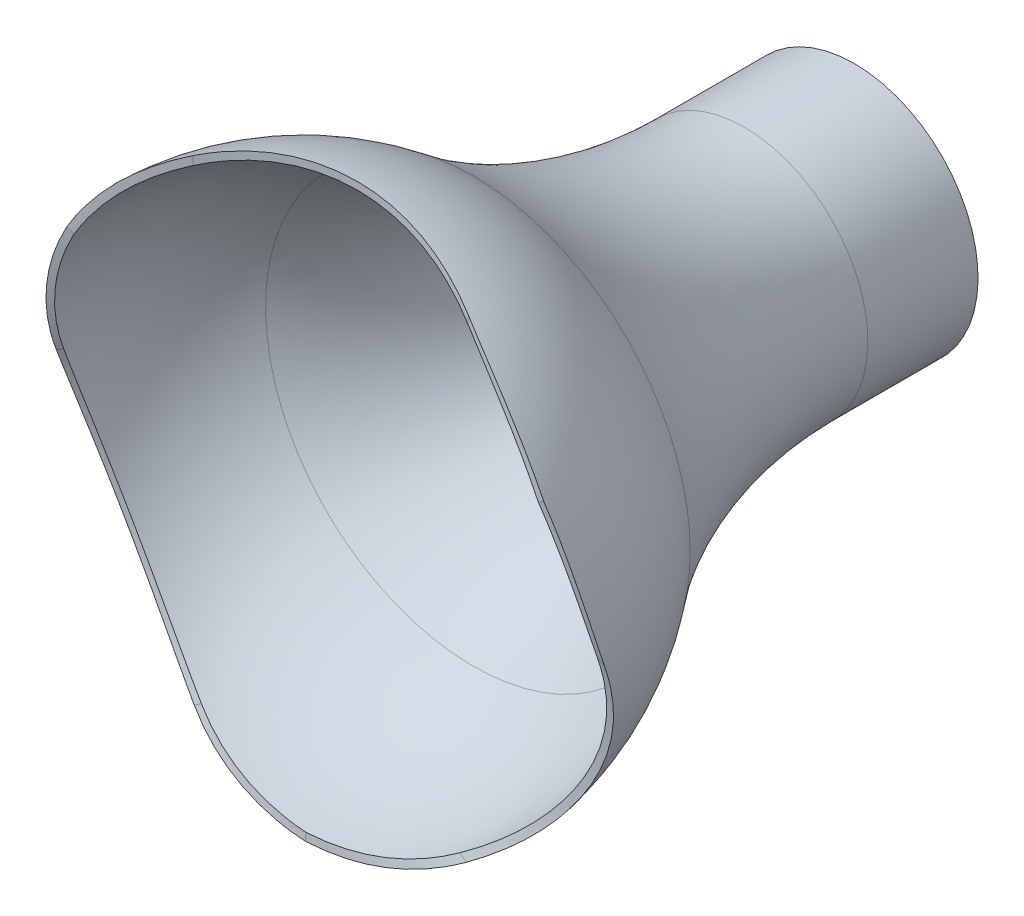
ISO-10303-21;
HEADER;
FILE_DESCRIPTION(('STEP AP214'),'2;1');
FILE_NAME('part.step','',(''),(''),'','','');
FILE_SCHEMA(('AUTOMOTIVE_DESIGN { 1 0 10303 214 1 1 1 1 }'));
ENDSEC;
DATA;
#1=APPLICATION_CONTEXT('core data for automotive mechanical design processes');
#2=APPLICATION_PROTOCOL_DEFINITION('international standard','automotive_design',2000,#1);
#3=PRODUCT_CONTEXT('',#1,'mechanical');
#4=PRODUCT('Part','Part','',(#3));
#5=PRODUCT_RELATED_PRODUCT_CATEGORY('part','',(#4));
#6=PRODUCT_DEFINITION_FORMATION('','',#4);
#7=PRODUCT_DEFINITION_CONTEXT('part definition',#1,'design');
#8=PRODUCT_DEFINITION('design','',#6,#7);
#9=PRODUCT_DEFINITION_SHAPE('','',#8);
#10=(LENGTH_UNIT() NAMED_UNIT(*) SI_UNIT(.MILLI.,.METRE.));
#11=(NAMED_UNIT(*) PLANE_ANGLE_UNIT() SI_UNIT($,.RADIAN.));
#12=(NAMED_UNIT(*) SI_UNIT($,.STERADIAN.) SOLID_ANGLE_UNIT());
#13=UNCERTAINTY_MEASURE_WITH_UNIT(LENGTH_MEASURE(1.E-05),#10,'distance_accuracy_value','');
#14=(GEOMETRIC_REPRESENTATION_CONTEXT(3) GLOBAL_UNCERTAINTY_ASSIGNED_CONTEXT((#13)) GLOBAL_UNIT_ASSIGNED_CONTEXT((#10,
#11,#12)) REPRESENTATION_CONTEXT('',''));
#15=CARTESIAN_POINT('',(0.,0.,0.));
#16=DIRECTION('',(0.,0.,1.));
#17=DIRECTION('',(1.,0.,0.));
#18=AXIS2_PLACEMENT_3D('',#15,#16,#17);
#19=CARTESIAN_POINT('',(0.,44.9999999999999,45.));
#20=DIRECTION('',(0.,0.,-1.));
#21=DIRECTION('',(1.,0.,0.));
#22=AXIS2_PLACEMENT_3D('',#19,#20,#21);
#23=SPHERICAL_SURFACE('',#22,43.8);
#24=CARTESIAN_POINT('',(0.,45.,17.2878269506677));
#25=DIRECTION('',(0.,0.,-1.));
#26=DIRECTION('',(0.,1.,0.));
#27=AXIS2_PLACEMENT_3D('',#24,#25,#26);
#28=CIRCLE('',#27,33.918659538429);
#29=CARTESIAN_POINT('',(0.,78.918659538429,17.2878269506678));
#30=VERTEX_POINT('',#29);
#31=EDGE_CURVE('E338',#30,#30,#28,.T.);
#32=ORIENTED_EDGE('',*,*,#31,.T.);
#33=EDGE_LOOP('',(#32));
#34=FACE_BOUND('',#33,.T.);
#35=CARTESIAN_POINT('',(21.070460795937,6.85363334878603,40.6033657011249));
#36=CARTESIAN_POINT('',(21.5221335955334,7.12468444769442,40.4161978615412));
#37=CARTESIAN_POINT('',(21.969775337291,7.40533137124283,40.2331884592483));
#38=CARTESIAN_POINT('',(22.8564992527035,7.98539403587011,39.8763489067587));
#39=CARTESIAN_POINT('',(23.29558111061,8.28481046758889,39.7025190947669));
#40=CARTESIAN_POINT('',(24.1647649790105,8.9020477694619,39.364872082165));
#41=CARTESIAN_POINT('',(24.5948646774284,9.21987330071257,39.2010574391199));
#42=CARTESIAN_POINT('',(25.4453870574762,9.87332312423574,38.8843123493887));
#43=CARTESIAN_POINT('',(25.8658098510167,10.2089472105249,38.7313817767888));
#44=CARTESIAN_POINT('',(27.1125717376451,11.2424263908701,38.2897903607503));
#45=CARTESIAN_POINT('',(27.9237338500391,11.9664119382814,38.0185920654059));
#46=CARTESIAN_POINT('',(29.50037571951,13.4786192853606,37.528461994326));
#47=CARTESIAN_POINT('',(30.2658603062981,14.2668342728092,37.3095246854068));
#48=CARTESIAN_POINT('',(31.7481595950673,15.9037180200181,36.9279080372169));
#49=CARTESIAN_POINT('',(32.4648705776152,16.752508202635,36.7653457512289));
#50=CARTESIAN_POINT('',(33.8430734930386,18.5027714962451,36.5004930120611));
#51=CARTESIAN_POINT('',(34.5045630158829,19.4042469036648,36.3982051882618));
#52=CARTESIAN_POINT('',(35.7669237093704,21.2520012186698,36.2561237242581));
#53=CARTESIAN_POINT('',(36.3678578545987,22.1982320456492,36.2162645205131));
#54=CARTESIAN_POINT('',(37.5053945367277,24.1290832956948,36.1996746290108));
#55=CARTESIAN_POINT('',(38.042000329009,25.1137017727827,36.2229407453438));
#56=CARTESIAN_POINT('',(39.0319999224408,27.0844868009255,36.3304946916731));
#57=CARTESIAN_POINT('',(39.4873746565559,28.0697587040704,36.4129704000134));
#58=CARTESIAN_POINT('',(40.3302658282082,30.0626533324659,36.6353009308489));
#59=CARTESIAN_POINT('',(40.717779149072,31.0702770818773,36.775158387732));
#60=CARTESIAN_POINT('',(41.4220704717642,33.1013883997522,37.1095618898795));
#61=CARTESIAN_POINT('',(41.7388240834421,34.1248813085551,37.3041267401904));
#62=CARTESIAN_POINT('',(42.2988986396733,36.1807853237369,37.7441378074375));
#63=CARTESIAN_POINT('',(42.5422368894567,37.2131942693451,37.9895720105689));
#64=CARTESIAN_POINT('',(42.873942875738,38.8805529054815,38.4225983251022));
#65=CARTESIAN_POINT('',(42.9858396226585,39.5146958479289,38.5958166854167));
#66=CARTESIAN_POINT('',(43.1809870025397,40.7827832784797,38.9583374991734));
#67=CARTESIAN_POINT('',(43.26423956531,41.4167277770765,39.1476388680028));
#68=CARTESIAN_POINT('',(43.4016016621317,42.6813802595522,39.54043648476));
#69=CARTESIAN_POINT('',(43.4557924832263,43.3120923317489,39.7438913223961));
#70=CARTESIAN_POINT('',(43.5351799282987,44.571032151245,40.1640545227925));
#71=CARTESIAN_POINT('',(43.5603720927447,45.1992595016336,40.3807649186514));
#72=CARTESIAN_POINT('',(43.5709529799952,45.8256290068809,40.6033657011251));
#73=B_SPLINE_CURVE_WITH_KNOTS('',3,(#35,#36,#37,#38,#39,#40,#41,#42,#43,#44,#45,#46,#47,#48,#49,
#50,#51,#52,#53,#54,#55,#56,#57,#58,#59,#60,#61,#62,#63,#64,#65,#66,#67,#68,#69,#70,#71,#72),
.UNSPECIFIED.,.F.,.F.,(4,2,2,2,2,2,2,2,2,2,2,2,2,2,2,2,2,2,4),(0.,1.67696531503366,
3.35399237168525,5.03144591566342,6.70888005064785,10.0663304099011,13.4234251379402,
16.7874491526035,20.1516199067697,23.5122551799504,26.8727203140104,30.1344969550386,
33.3964233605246,36.6594723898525,39.921751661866,41.9215237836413,43.9211611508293,
45.9151758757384,47.9094972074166),.UNSPECIFIED.);
#74=CARTESIAN_POINT('',(21.0709434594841,6.85392300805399,40.6031657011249));
#75=VERTEX_POINT('',#74);
#76=CARTESIAN_POINT('',(43.5709434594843,45.8250661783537,40.6031657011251));
#77=VERTEX_POINT('',#76);
#78=EDGE_CURVE('E256',#75,#77,#73,.T.);
#79=ORIENTED_EDGE('',*,*,#78,.T.);
#80=CARTESIAN_POINT('',(43.5709339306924,45.8245033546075,40.6029657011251));
#81=CARTESIAN_POINT('',(43.5794341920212,46.3258714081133,40.7811412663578));
#82=CARTESIAN_POINT('',(43.5773866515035,46.8299649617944,40.9520470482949));
#83=CARTESIAN_POINT('',(43.5523226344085,47.8421348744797,41.2797328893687));
#84=CARTESIAN_POINT('',(43.5293090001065,48.3502106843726,41.4365148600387));
#85=CARTESIAN_POINT('',(43.4624749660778,49.3685067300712,41.7362657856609));
#86=CARTESIAN_POINT('',(43.4186752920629,49.8787243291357,41.8792483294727));
#87=CARTESIAN_POINT('',(43.3104694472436,50.9004515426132,42.1520985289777));
#88=CARTESIAN_POINT('',(43.2460626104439,51.4119611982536,42.2819657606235));
#89=CARTESIAN_POINT('',(43.0231327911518,52.94033961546,42.6512485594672));
#90=CARTESIAN_POINT('',(42.8344752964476,53.9574722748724,42.8722091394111));
#91=CARTESIAN_POINT('',(42.3785623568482,55.982756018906,43.2696164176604));
#92=CARTESIAN_POINT('',(42.1112880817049,56.9909048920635,43.4460524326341));
#93=CARTESIAN_POINT('',(41.5017169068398,58.9863038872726,43.7593031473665));
#94=CARTESIAN_POINT('',(41.1597023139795,59.9736177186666,43.896262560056));
#95=CARTESIAN_POINT('',(40.4027918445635,61.9238963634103,44.1369781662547));
#96=CARTESIAN_POINT('',(39.9879005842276,62.8868627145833,44.2407364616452));
#97=CARTESIAN_POINT('',(39.0873783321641,64.783663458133,44.4207102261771));
#98=CARTESIAN_POINT('',(38.6016341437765,65.7174482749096,44.4968809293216));
#99=CARTESIAN_POINT('',(37.5629861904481,67.5485031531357,44.6267308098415));
#100=CARTESIAN_POINT('',(37.0100794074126,68.4457715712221,44.680408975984));
#101=CARTESIAN_POINT('',(35.7901273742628,70.2738388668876,44.7740401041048));
#102=CARTESIAN_POINT('',(35.1173583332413,71.2009029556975,44.8124190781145));
#103=CARTESIAN_POINT('',(33.7008614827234,72.9997827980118,44.8740761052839));
#104=CARTESIAN_POINT('',(32.9571258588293,73.8715924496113,44.8973524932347));
#105=CARTESIAN_POINT('',(31.4040102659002,75.5537857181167,44.933571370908));
#106=CARTESIAN_POINT('',(30.5946724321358,76.364208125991,44.9465204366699));
#107=CARTESIAN_POINT('',(28.9150944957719,77.9190710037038,44.9659304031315));
#108=CARTESIAN_POINT('',(28.04486943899,78.6635276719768,44.9723929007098));
#109=CARTESIAN_POINT('',(26.5893741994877,79.8130722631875,44.9798185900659));
#110=CARTESIAN_POINT('',(26.0210926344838,80.2398545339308,44.9819377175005));
#111=CARTESIAN_POINT('',(24.8645197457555,81.0652179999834,44.9851427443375));
#112=CARTESIAN_POINT('',(24.2762322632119,81.4638045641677,44.9862288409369));
#113=CARTESIAN_POINT('',(23.0818779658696,82.2313018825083,44.9876442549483));
#114=CARTESIAN_POINT('',(22.4758394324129,82.6002566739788,44.9879747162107));
#115=CARTESIAN_POINT('',(21.2464492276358,83.3083784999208,44.9879288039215));
#116=CARTESIAN_POINT('',(20.6230942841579,83.6475398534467,44.9875522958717));
#117=CARTESIAN_POINT('',(19.9918543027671,83.9713431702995,44.9868455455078));
#118=B_SPLINE_CURVE_WITH_KNOTS('',3,(#80,#81,#82,#83,#84,#85,#86,#87,#88,#89,#90,#91,#92,#93,
#94,#95,#96,#97,#98,#99,#100,#101,#102,#103,#104,#105,#106,#107,#108,#109,#110,#111,#112,#113,
#114,#115,#116,#117),.UNSPECIFIED.,.F.,.F.,(4,2,2,2,2,2,2,2,2,2,2,2,2,2,2,2,2,2,4),(0.,
1.59625072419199,3.19228508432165,4.78673137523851,6.38122920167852,9.5502190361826,
12.7199685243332,15.8779461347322,19.0357237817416,22.1986027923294,25.3616239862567,
28.7961987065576,32.2311520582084,35.6639164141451,39.0958354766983,41.2271807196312,
43.3581190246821,45.4858294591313,47.6139447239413),.UNSPECIFIED.);
#119=CARTESIAN_POINT('',(37.9301719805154,66.8989950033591,44.5803914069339));
#120=VERTEX_POINT('',#119);
#121=EDGE_CURVE('E128',#77,#120,#118,.T.);
#122=ORIENTED_EDGE('',*,*,#121,.T.);
#123=CARTESIAN_POINT('',(43.7999983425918,44.9997999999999,44.9879522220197));
#124=CARTESIAN_POINT('',(43.8000091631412,45.6108374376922,44.9879348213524));
#125=CARTESIAN_POINT('',(43.7872176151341,46.2218744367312,44.9876949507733));
#126=CARTESIAN_POINT('',(43.7360880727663,47.4428633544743,44.9866447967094));
#127=CARTESIAN_POINT('',(43.6977507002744,48.0528152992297,44.98583452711));
#128=CARTESIAN_POINT('',(43.5955881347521,49.2705757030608,44.9835181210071));
#129=CARTESIAN_POINT('',(43.5317631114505,49.8783841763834,44.9820119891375));
#130=CARTESIAN_POINT('',(43.3787379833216,51.0908092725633,44.9780562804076));
#131=CARTESIAN_POINT('',(43.2895373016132,51.6954258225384,44.9756066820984));
#132=CARTESIAN_POINT('',(43.0859083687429,52.9004422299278,44.9694292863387));
#133=CARTESIAN_POINT('',(42.9714780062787,53.5008417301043,44.9657013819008));
#134=CARTESIAN_POINT('',(42.7176061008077,54.6962684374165,44.9565397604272));
#135=CARTESIAN_POINT('',(42.5781663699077,55.2912960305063,44.9511061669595));
#136=CARTESIAN_POINT('',(42.2745290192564,56.4749115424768,44.9380195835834));
#137=CARTESIAN_POINT('',(42.1103343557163,57.0635002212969,44.9303668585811));
#138=CARTESIAN_POINT('',(41.757437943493,58.2333769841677,44.912237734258));
#139=CARTESIAN_POINT('',(41.568729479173,58.8146630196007,44.9017605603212));
#140=CARTESIAN_POINT('',(40.9661303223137,60.5464693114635,44.8650833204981));
#141=CARTESIAN_POINT('',(40.5158877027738,61.6844629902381,44.8336417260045));
#142=CARTESIAN_POINT('',(39.5218880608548,63.9180863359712,44.7505068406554));
#143=CARTESIAN_POINT('',(38.9781349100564,65.0137177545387,44.6988143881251));
#144=CARTESIAN_POINT('',(38.0953968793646,66.6193478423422,44.6005774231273));
#145=CARTESIAN_POINT('',(37.7897661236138,67.1485558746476,44.5643545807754));
#146=CARTESIAN_POINT('',(37.1568134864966,68.1930871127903,44.4840068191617));
#147=CARTESIAN_POINT('',(36.8294970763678,68.7084137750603,44.4398838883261));
#148=CARTESIAN_POINT('',(36.1537814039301,69.7242091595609,44.342701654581));
#149=CARTESIAN_POINT('',(35.8053817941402,70.2246776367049,44.2896422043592));
#150=CARTESIAN_POINT('',(35.0882634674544,71.209641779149,44.1735273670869));
#151=CARTESIAN_POINT('',(34.7195435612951,71.6941365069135,44.110471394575));
#152=CARTESIAN_POINT('',(33.6039973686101,73.0969558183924,43.9082871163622));
#153=CARTESIAN_POINT('',(32.8297898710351,73.9915965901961,43.7536693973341));
#154=CARTESIAN_POINT('',(31.2140904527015,75.7077086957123,43.3942539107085));
#155=CARTESIAN_POINT('',(30.3725823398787,76.5291623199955,43.1894440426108));
#156=CARTESIAN_POINT('',(29.068410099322,77.6978909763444,42.839301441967));
#157=CARTESIAN_POINT('',(28.627489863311,78.0762992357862,42.7156802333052));
#158=CARTESIAN_POINT('',(27.7324212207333,78.8115209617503,42.4531778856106));
#159=CARTESIAN_POINT('',(27.2782747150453,79.1683375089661,42.3142989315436));
#160=CARTESIAN_POINT('',(26.3584629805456,79.8589514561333,42.0205666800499));
#161=CARTESIAN_POINT('',(25.8928078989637,80.1927682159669,41.8657270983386));
#162=CARTESIAN_POINT('',(24.9511123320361,80.8365312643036,41.5392451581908));
#163=CARTESIAN_POINT('',(24.475074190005,81.1464828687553,41.3676065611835));
#164=CARTESIAN_POINT('',(23.747613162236,81.5968736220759,41.0945227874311));
#165=CARTESIAN_POINT('',(23.4994288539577,81.7465068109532,40.9994890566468));
#166=CARTESIAN_POINT('',(23.001082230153,82.0389432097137,40.8047904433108));
#167=CARTESIAN_POINT('',(22.750921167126,82.1817503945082,40.7051283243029));
#168=CARTESIAN_POINT('',(22.4998,82.3211218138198,40.6030844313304));
#169=B_SPLINE_CURVE_WITH_KNOTS('',3,(#123,#124,#125,#126,#127,#128,#129,#130,#131,#132,#133,
#134,#135,#136,#137,#138,#139,#140,#141,#142,#143,#144,#145,#146,#147,#148,#149,#150,#151,#152,
#153,#154,#155,#156,#157,#158,#159,#160,#161,#162,#163,#164,#165,#166,#167,#168),.UNSPECIFIED.,
.F.,.F.,(4,2,2,2,2,2,2,2,2,2,2,2,2,2,2,2,2,2,2,2,2,2,4),(0.,1.83297763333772,3.66591064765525,
5.49883145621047,7.33179393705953,9.16490986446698,10.997893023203,12.8306574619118,
14.6639250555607,18.3319259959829,21.9997751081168,23.8358660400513,25.6714954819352,
27.5071551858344,29.3429224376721,32.9172426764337,36.4924254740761,38.2739398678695,
40.0551994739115,41.8349409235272,43.6142847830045,44.5291419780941,45.4434597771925),.UNSPECIFIED.);
#170=CARTESIAN_POINT('',(22.5,82.3210108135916,40.6031657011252));
#171=VERTEX_POINT('',#170);
#172=EDGE_CURVE('E69',#120,#171,#169,.T.);
#173=ORIENTED_EDGE('',*,*,#172,.T.);
#174=CARTESIAN_POINT('',(22.5002,82.3208998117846,40.60324697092));
#175=CARTESIAN_POINT('',(22.0396244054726,82.5765305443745,40.41608112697));
#176=CARTESIAN_POINT('',(21.5727541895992,82.8238723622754,40.2330738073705));
#177=CARTESIAN_POINT('',(20.62703943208,83.3017587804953,39.8762385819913));
#178=CARTESIAN_POINT('',(20.1481944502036,83.5323027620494,39.7024110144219));
#179=CARTESIAN_POINT('',(19.179055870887,83.9764117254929,39.3647686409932));
#180=CARTESIAN_POINT('',(18.68875939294,84.1899723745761,39.2009563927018));
#181=CARTESIAN_POINT('',(17.6975909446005,84.5998137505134,38.8842162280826));
#182=CARTESIAN_POINT('',(17.1967190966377,84.7960946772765,38.7312881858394));
#183=CARTESIAN_POINT('',(15.6783149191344,85.3590709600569,38.2897045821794));
#184=CARTESIAN_POINT('',(14.6457417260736,85.6995574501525,38.0185117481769));
#185=CARTESIAN_POINT('',(12.547807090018,86.3088502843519,37.5283929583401));
#186=CARTESIAN_POINT('',(11.4824491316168,86.5776642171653,37.3094614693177));
#187=CARTESIAN_POINT('',(9.32371451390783,87.0429159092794,36.9278567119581));
#188=CARTESIAN_POINT('',(8.23028456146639,87.2392031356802,36.765300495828));
#189=CARTESIAN_POINT('',(6.02541027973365,87.5576151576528,36.5004599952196));
#190=CARTESIAN_POINT('',(4.91396516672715,87.6797367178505,36.398178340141));
#191=CARTESIAN_POINT('',(2.68258390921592,87.8490812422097,36.2561091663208));
#192=CARTESIAN_POINT('',(1.56265791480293,87.8963827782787,36.216256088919));
#193=CARTESIAN_POINT('',(-0.678273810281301,87.9160784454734,36.1996782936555));
#194=CARTESIAN_POINT('',(-1.79927948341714,87.8884763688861,36.2229503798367));
#195=CARTESIAN_POINT('',(-4.00102580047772,87.7604348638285,36.3305158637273));
#196=CARTESIAN_POINT('',(-5.08198213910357,87.6621582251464,36.4129972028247));
#197=CARTESIAN_POINT('',(-7.22932134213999,87.3956626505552,36.6353387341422));
#198=CARTESIAN_POINT('',(-8.29570353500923,87.2274405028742,36.7752015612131));
#199=CARTESIAN_POINT('',(-10.4068379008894,86.8218058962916,37.1096154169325));
#200=CARTESIAN_POINT('',(-11.4515825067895,86.5843696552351,37.3041852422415));
#201=CARTESIAN_POINT('',(-13.512078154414,86.0414437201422,37.7442057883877));
#202=CARTESIAN_POINT('',(-14.5278359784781,85.7359700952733,37.9896444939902));
#203=CARTESIAN_POINT('',(-16.1376069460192,85.1895638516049,38.4226640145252));
#204=CARTESIAN_POINT('',(-16.7426872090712,84.9694133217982,38.5958698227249));
#205=CARTESIAN_POINT('',(-17.9383551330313,84.5044073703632,38.9583627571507));
#206=CARTESIAN_POINT('',(-18.528943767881,84.2595536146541,39.1476487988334));
#207=CARTESIAN_POINT('',(-19.6927493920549,83.7462297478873,39.5404133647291));
#208=CARTESIAN_POINT('',(-20.2660105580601,83.4778279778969,39.7438504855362));
#209=CARTESIAN_POINT('',(-21.3958871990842,82.9171608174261,40.1639761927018));
#210=CARTESIAN_POINT('',(-21.9525001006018,82.624891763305,40.3806668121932));
#211=CARTESIAN_POINT('',(-22.5002,82.3208998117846,40.60324697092));
#212=B_SPLINE_CURVE_WITH_KNOTS('',3,(#174,#175,#176,#177,#178,#179,#180,#181,#182,#183,#184,
#185,#186,#187,#188,#189,#190,#191,#192,#193,#194,#195,#196,#197,#198,#199,#200,#201,#202,#203,
#204,#205,#206,#207,#208,#209,#210,#211),.UNSPECIFIED.,.F.,.F.,(4,2,2,2,2,2,2,2,2,2,2,2,2,2,2,2,
2,2,4),(0.,1.67696313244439,3.35398800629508,5.03143936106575,6.70887130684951,10.0663169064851,
13.4234068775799,16.7874260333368,20.1515919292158,23.5122226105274,26.8726831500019,
30.1344583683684,33.3963833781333,36.6594305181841,39.9217078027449,41.9213133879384,
43.9207842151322,45.9146328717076,47.9087881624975),.UNSPECIFIED.);
#213=CARTESIAN_POINT('',(-22.5,82.3210108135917,40.6031657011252));
#214=VERTEX_POINT('',#213);
#215=EDGE_CURVE('E214',#171,#214,#212,.T.);
#216=ORIENTED_EDGE('',*,*,#215,.T.);
#217=CARTESIAN_POINT('',(-22.4998,82.3211218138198,40.6030844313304));
#218=CARTESIAN_POINT('',(-22.9382666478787,82.077783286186,40.7812650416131));
#219=CARTESIAN_POINT('',(-23.3738193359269,81.8239464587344,40.9521752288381));
#220=CARTESIAN_POINT('',(-24.2378884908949,81.2961201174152,41.279868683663));
#221=CARTESIAN_POINT('',(-24.6664059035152,81.0221333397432,41.4366538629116));
#222=CARTESIAN_POINT('',(-25.514893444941,80.4550668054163,41.7364101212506));
#223=CARTESIAN_POINT('',(-25.9348716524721,80.1620063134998,41.879394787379));
#224=CARTESIAN_POINT('',(-26.7656425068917,79.5573921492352,42.1522482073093));
#225=CARTESIAN_POINT('',(-27.1764348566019,79.2458378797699,42.2821165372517));
#226=CARTESIAN_POINT('',(-28.3885600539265,78.2885737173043,42.6513803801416));
#227=CARTESIAN_POINT('',(-29.1750555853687,77.6166386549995,42.8723237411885));
#228=CARTESIAN_POINT('',(-30.7009715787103,76.2091977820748,43.2697007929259));
#229=CARTESIAN_POINT('',(-31.4403807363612,75.4736768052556,43.446123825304));
#230=CARTESIAN_POINT('',(-32.8635817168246,73.9481294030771,43.7593500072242));
#231=CARTESIAN_POINT('',(-33.5475706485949,73.1583164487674,43.8962984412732));
#232=CARTESIAN_POINT('',(-34.8580279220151,71.527752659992,44.1369962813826));
#233=CARTESIAN_POINT('',(-35.484499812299,70.6870049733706,44.2407477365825));
#234=CARTESIAN_POINT('',(-36.6769207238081,68.9587171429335,44.4207213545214));
#235=CARTESIAN_POINT('',(-37.242763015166,68.0710984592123,44.4968955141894));
#236=CARTESIAN_POINT('',(-38.3092332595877,66.255957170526,44.6267494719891));
#237=CARTESIAN_POINT('',(-38.8098586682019,65.3284330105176,44.6804283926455));
#238=CARTESIAN_POINT('',(-39.7831335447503,63.3576394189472,44.7740656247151));
#239=CARTESIAN_POINT('',(-40.2496761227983,62.3112752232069,44.8124472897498));
#240=CARTESIAN_POINT('',(-41.099415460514,60.1846791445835,44.8741067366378));
#241=CARTESIAN_POINT('',(-41.4826009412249,59.1044427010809,44.8973824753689));
#242=CARTESIAN_POINT('',(-42.1627986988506,56.9182118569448,44.9335916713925));
#243=CARTESIAN_POINT('',(-42.4598950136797,55.812243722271,44.9465352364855));
#244=CARTESIAN_POINT('',(-42.9664988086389,53.5806306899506,44.9659369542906));
#245=CARTESIAN_POINT('',(-43.1760364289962,52.4549927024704,44.9723973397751));
#246=CARTESIAN_POINT('',(-43.4175919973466,50.7993719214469,44.9790944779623));
#247=CARTESIAN_POINT('',(-43.4845024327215,50.2742687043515,44.9808101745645));
#248=CARTESIAN_POINT('',(-43.5992417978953,49.2220582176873,44.9836115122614));
#249=CARTESIAN_POINT('',(-43.6470746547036,48.6949513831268,44.9846972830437));
#250=CARTESIAN_POINT('',(-43.7235415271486,47.6402354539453,44.9863806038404));
#251=CARTESIAN_POINT('',(-43.7522073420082,47.1126286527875,44.9869789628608));
#252=CARTESIAN_POINT('',(-43.7904408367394,46.0566160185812,44.9877600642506));
#253=CARTESIAN_POINT('',(-43.8000046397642,45.5282100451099,44.9879427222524));
#254=CARTESIAN_POINT('',(-43.7999983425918,44.9997999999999,44.9879522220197));
#255=B_SPLINE_CURVE_WITH_KNOTS('',3,(#217,#218,#219,#220,#221,#222,#223,#224,#225,#226,#227,
#228,#229,#230,#231,#232,#233,#234,#235,#236,#237,#238,#239,#240,#241,#242,#243,#244,#245,#246,
#247,#248,#249,#250,#251,#252,#253,#254),.UNSPECIFIED.,.F.,.F.,(4,2,2,2,2,2,2,2,2,2,2,2,2,2,2,2,
2,2,4),(0.,1.59632470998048,3.19243305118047,4.78695359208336,6.38152564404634,9.5503939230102,
12.7200201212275,15.8778271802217,19.0354392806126,22.1985216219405,25.3617273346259,
28.7969225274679,32.2325822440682,35.6648767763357,39.0959888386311,40.6837699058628,
42.2712239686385,43.856037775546,45.441173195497),.UNSPECIFIED.);
#256=CARTESIAN_POINT('',(-37.9301719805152,66.8989950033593,44.5803914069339));
#257=VERTEX_POINT('',#256);
#258=EDGE_CURVE('E206',#214,#257,#255,.T.);
#259=ORIENTED_EDGE('',*,*,#258,.T.);
#260=CARTESIAN_POINT('',(-19.9918543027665,83.9713431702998,44.9868455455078));
#261=CARTESIAN_POINT('',(-20.5371347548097,83.6916298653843,44.9874655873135));
#262=CARTESIAN_POINT('',(-21.0765369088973,83.4004583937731,44.9878276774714));
#263=CARTESIAN_POINT('',(-22.1426385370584,82.7957507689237,44.9880254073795));
#264=CARTESIAN_POINT('',(-22.6693383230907,82.4822151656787,44.9878610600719));
#265=CARTESIAN_POINT('',(-23.7091033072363,81.8333250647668,44.9869954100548));
#266=CARTESIAN_POINT('',(-24.2221688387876,81.4979711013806,44.9862941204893));
#267=CARTESIAN_POINT('',(-25.2337867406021,80.8060231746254,44.9842190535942));
#268=CARTESIAN_POINT('',(-25.7323387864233,80.449428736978,44.9828452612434));
#269=CARTESIAN_POINT('',(-26.7139174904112,79.7157247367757,44.9791998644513));
#270=CARTESIAN_POINT('',(-27.196947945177,79.3386202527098,44.9769284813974));
#271=CARTESIAN_POINT('',(-28.1467232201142,78.5645119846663,44.9711648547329));
#272=CARTESIAN_POINT('',(-28.6134691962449,78.1675096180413,44.9676726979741));
#273=CARTESIAN_POINT('',(-29.5298413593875,77.3543193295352,44.9590537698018));
#274=CARTESIAN_POINT('',(-29.9794694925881,76.9381336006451,44.9539271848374));
#275=CARTESIAN_POINT('',(-30.8609507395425,76.0871973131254,44.9415296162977));
#276=CARTESIAN_POINT('',(-31.2927990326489,75.6524417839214,44.9342580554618));
#277=CARTESIAN_POINT('',(-32.5607038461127,74.3212244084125,44.9083576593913));
#278=CARTESIAN_POINT('',(-33.3689013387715,73.3980061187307,44.8856446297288));
#279=CARTESIAN_POINT('',(-34.9046633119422,71.4872913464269,44.8236799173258));
#280=CARTESIAN_POINT('',(-35.6322302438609,70.4997968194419,44.7844287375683));
#281=CARTESIAN_POINT('',(-36.6591947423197,68.9757166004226,44.7080127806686));
#282=CARTESIAN_POINT('',(-36.9909554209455,68.4602450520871,44.6795964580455));
#283=CARTESIAN_POINT('',(-37.6322145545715,67.4161787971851,44.615962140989));
#284=CARTESIAN_POINT('',(-37.9417186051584,66.8875874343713,44.5807458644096));
#285=CARTESIAN_POINT('',(-38.5379089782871,65.8182220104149,44.5025184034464));
#286=CARTESIAN_POINT('',(-38.8245945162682,65.2774475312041,44.4595069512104));
#287=CARTESIAN_POINT('',(-39.3745299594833,64.1848679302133,44.3646573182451));
#288=CARTESIAN_POINT('',(-39.6377784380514,63.633062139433,44.3128186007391));
#289=CARTESIAN_POINT('',(-40.3819368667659,61.9839726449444,44.1446177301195));
#290=CARTESIAN_POINT('',(-40.8287036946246,60.8724468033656,44.014147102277));
#291=CARTESIAN_POINT('',(-41.6255262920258,58.6210408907,43.7067870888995));
#292=CARTESIAN_POINT('',(-41.9755623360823,57.4811550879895,43.5298882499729));
#293=CARTESIAN_POINT('',(-42.4245972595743,55.7610313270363,43.223968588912));
#294=CARTESIAN_POINT('',(-42.5614604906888,55.1867900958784,43.1154221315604));
#295=CARTESIAN_POINT('',(-42.8097677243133,54.0357767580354,42.8837883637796));
#296=CARTESIAN_POINT('',(-42.9212152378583,53.4590050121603,42.760703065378));
#297=CARTESIAN_POINT('',(-43.1182417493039,52.3049659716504,42.4991428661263));
#298=CARTESIAN_POINT('',(-43.2038383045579,51.7276992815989,42.3606784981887));
#299=CARTESIAN_POINT('',(-43.3489171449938,50.57411623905,42.0674403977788));
#300=CARTESIAN_POINT('',(-43.408405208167,49.9977997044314,41.9126702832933));
#301=CARTESIAN_POINT('',(-43.4790466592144,49.1206353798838,41.6634998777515));
#302=CARTESIAN_POINT('',(-43.4997432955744,48.8187619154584,41.5752771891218));
#303=CARTESIAN_POINT('',(-43.5338119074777,48.2161166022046,41.3940220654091));
#304=CARTESIAN_POINT('',(-43.5471856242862,47.9153445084,41.3009907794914));
#305=CARTESIAN_POINT('',(-43.5665806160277,47.3152941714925,41.1100599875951));
#306=CARTESIAN_POINT('',(-43.5726059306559,47.0160151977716,41.0121631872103));
#307=CARTESIAN_POINT('',(-43.5772974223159,46.4190048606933,40.8113471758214));
#308=CARTESIAN_POINT('',(-43.5759617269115,46.1212739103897,40.7084266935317));
#309=CARTESIAN_POINT('',(-43.5709339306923,45.824503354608,40.6029657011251));
#310=B_SPLINE_CURVE_WITH_KNOTS('',3,(#260,#261,#262,#263,#264,#265,#266,#267,#268,#269,#270,
#271,#272,#273,#274,#275,#276,#277,#278,#279,#280,#281,#282,#283,#284,#285,#286,#287,#288,#289,
#290,#291,#292,#293,#294,#295,#296,#297,#298,#299,#300,#301,#302,#303,#304,#305,#306,#307,#308,
#309),.UNSPECIFIED.,.F.,.F.,(4,2,2,2,2,2,2,2,2,2,2,2,2,2,2,2,2,2,2,2,2,2,2,2,4),(0.,
1.83837860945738,3.67671202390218,5.51500043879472,7.35332991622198,9.19120625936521,
11.0289518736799,12.8664879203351,14.7045189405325,18.3814564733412,22.0582821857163,
23.898787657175,25.7388287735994,27.5789331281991,29.4191494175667,33.0290912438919,
36.6397686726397,38.439838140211,40.2396587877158,42.0382542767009,43.8364515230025,
44.7818917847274,45.7271071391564,46.6718026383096,47.6167384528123),.UNSPECIFIED.);
#311=CARTESIAN_POINT('',(-43.5709434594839,45.8250661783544,40.6031657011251));
#312=VERTEX_POINT('',#311);
#313=EDGE_CURVE('E234',#257,#312,#310,.T.);
#314=ORIENTED_EDGE('',*,*,#313,.T.);
#315=CARTESIAN_POINT('',(-43.5709529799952,45.8256290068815,40.6033657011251));
#316=CARTESIAN_POINT('',(-43.5620522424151,45.2989433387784,40.4161978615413));
#317=CARTESIAN_POINT('',(-43.542825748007,44.7709507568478,40.2331884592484));
#318=CARTESIAN_POINT('',(-43.4838387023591,43.7129939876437,39.8763489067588));
#319=CARTESIAN_POINT('',(-43.4440773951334,43.1830297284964,39.702519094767));
#320=CARTESIAN_POINT('',(-43.3441261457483,42.1216757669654,39.3648720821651));
#321=CARTESIAN_POINT('',(-43.2839310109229,41.5902857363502,39.20105743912));
#322=CARTESIAN_POINT('',(-43.1432880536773,40.52698683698,38.8843123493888));
#323=CARTESIAN_POINT('',(-43.0628404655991,39.9950779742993,38.7313817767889));
#324=CARTESIAN_POINT('',(-42.7912021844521,38.3986109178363,38.2897903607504));
#325=CARTESIAN_POINT('',(-42.5697933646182,37.33413114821,38.018592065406));
#326=CARTESIAN_POINT('',(-42.0485043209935,35.2126155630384,37.5284619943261));
#327=CARTESIAN_POINT('',(-41.7486324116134,34.1555789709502,37.3095246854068));
#328=CARTESIAN_POINT('',(-41.0721991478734,32.05342825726,36.9279080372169));
#329=CARTESIAN_POINT('',(-40.6954807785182,31.0083432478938,36.765345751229));
#330=CARTESIAN_POINT('',(-39.8688097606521,28.9396528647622,36.5004930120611));
#331=CARTESIAN_POINT('',(-39.4188539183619,27.916048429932,36.3982051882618));
#332=CARTESIAN_POINT('',(-38.4498320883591,25.8989348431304,36.2561237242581));
#333=CARTESIAN_POINT('',(-37.930839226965,24.9053951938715,36.2162645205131));
#334=CARTESIAN_POINT('',(-36.8274413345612,22.9548339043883,36.1996746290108));
#335=CARTESIAN_POINT('',(-36.2430396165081,21.9978104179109,36.2229407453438));
#336=CARTESIAN_POINT('',(-35.0312895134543,20.1550531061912,36.3304946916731));
#337=CARTESIAN_POINT('',(-34.4057063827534,19.2680510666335,36.4129704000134));
#338=CARTESIAN_POINT('',(-33.1012545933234,17.5416385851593,36.6353009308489));
#339=CARTESIAN_POINT('',(-32.4223834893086,16.7022303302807,36.7751583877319));
#340=CARTESIAN_POINT('',(-31.015535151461,15.0767404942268,37.1095618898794));
#341=CARTESIAN_POINT('',(-30.2875410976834,14.2906773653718,37.3041267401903));
#342=CARTESIAN_POINT('',(-28.7871132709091,12.7776865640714,37.7441378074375));
#343=CARTESIAN_POINT('',(-28.0146900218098,12.0507449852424,37.9895720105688));
#344=CARTESIAN_POINT('',(-26.7365680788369,10.9297998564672,38.4225983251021));
#345=CARTESIAN_POINT('',(-26.2433325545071,10.5158229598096,38.5958166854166));
#346=CARTESIAN_POINT('',(-25.242710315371,9.71277665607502,38.9583374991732));
#347=CARTESIAN_POINT('',(-24.735324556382,9.32370557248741,39.1476388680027));
#348=CARTESIAN_POINT('',(-23.7087844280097,8.57242026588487,39.5404364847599));
#349=CARTESIAN_POINT('',(-23.1896671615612,8.21013360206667,39.743891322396));
#350=CARTESIAN_POINT('',(-22.139087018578,7.51191214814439,40.1640545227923));
#351=CARTESIAN_POINT('',(-21.6076222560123,7.17598141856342,40.3807649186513));
#352=CARTESIAN_POINT('',(-21.0704607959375,6.85363334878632,40.6033657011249));
#353=B_SPLINE_CURVE_WITH_KNOTS('',3,(#315,#316,#317,#318,#319,#320,#321,#322,#323,#324,#325,
#326,#327,#328,#329,#330,#331,#332,#333,#334,#335,#336,#337,#338,#339,#340,#341,#342,#343,#344,
#345,#346,#347,#348,#349,#350,#351,#352),.UNSPECIFIED.,.F.,.F.,(4,2,2,2,2,2,2,2,2,2,2,2,2,2,2,2,
2,2,4),(0.,1.67696531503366,3.35399237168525,5.03144591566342,6.70888005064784,10.0663304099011,
13.4234251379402,16.7874491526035,20.1516199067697,23.5122551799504,26.8727203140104,
30.1344969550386,33.3964233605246,36.6594723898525,39.921751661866,41.9215237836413,
43.9211611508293,45.9151758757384,47.9094972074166),.UNSPECIFIED.);
#354=CARTESIAN_POINT('',(-21.0709434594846,6.85392300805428,40.6031657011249));
#355=VERTEX_POINT('',#354);
#356=EDGE_CURVE('E242',#312,#355,#353,.T.);
#357=ORIENTED_EDGE('',*,*,#356,.T.);
#358=CARTESIAN_POINT('',(-21.0714261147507,6.85421267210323,40.6029657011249));
#359=CARTESIAN_POINT('',(-20.6397681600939,6.59514033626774,40.7818503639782));
#360=CARTESIAN_POINT('',(-20.200414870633,6.34390203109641,40.9534070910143));
#361=CARTESIAN_POINT('',(-19.3076657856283,5.85772340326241,41.2822849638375));
#362=CARTESIAN_POINT('',(-18.8542718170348,5.62278097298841,41.4396079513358));
#363=CARTESIAN_POINT('',(-17.9350652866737,5.16994784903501,41.7403577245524));
#364=CARTESIAN_POINT('',(-17.469263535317,4.95204292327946,41.8837961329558));
#365=CARTESIAN_POINT('',(-16.5261592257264,4.53358228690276,42.1574553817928));
#366=CARTESIAN_POINT('',(-16.0488563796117,4.33302701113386,42.2876758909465));
#367=CARTESIAN_POINT('',(-14.6247468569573,3.76730985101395,42.6534071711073));
#368=CARTESIAN_POINT('',(-13.6632998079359,3.42708079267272,42.8712174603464));
#369=CARTESIAN_POINT('',(-11.7098490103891,2.81718515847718,43.2635098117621));
#370=CARTESIAN_POINT('',(-10.7178440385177,2.54752141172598,43.4379901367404));
#371=CARTESIAN_POINT('',(-8.931331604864,2.131816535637,43.7147968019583));
#372=CARTESIAN_POINT('',(-8.14121709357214,1.97163385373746,43.8245553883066));
#373=CARTESIAN_POINT('',(-6.55077754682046,1.69601906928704,44.0234358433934));
#374=CARTESIAN_POINT('',(-5.75045412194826,1.58057999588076,44.1125609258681));
#375=CARTESIAN_POINT('',(-4.12724667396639,1.39305010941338,44.2743015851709));
#376=CARTESIAN_POINT('',(-3.3042259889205,1.32184259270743,44.3465637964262));
#377=CARTESIAN_POINT('',(-1.65418942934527,1.22654070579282,44.4749401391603));
#378=CARTESIAN_POINT('',(-0.827173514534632,1.20244681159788,44.5310541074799));
#379=CARTESIAN_POINT('',(0.000199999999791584,1.20200987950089,44.5804033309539));
#380=B_SPLINE_CURVE_WITH_KNOTS('',3,(#358,#359,#360,#361,#362,#363,#364,#365,#366,#367,#368,
#369,#370,#371,#372,#373,#374,#375,#376,#377,#378,#379),.UNSPECIFIED.,.F.,.F.,(4,2,2,2,2,2,2,2,
2,2,4),(0.,1.60260084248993,3.20499402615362,4.80603404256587,6.40711417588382,9.53149549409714,
12.6560020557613,15.0953547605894,17.5343272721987,20.0205594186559,22.506816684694),.UNSPECIFIED.);
#381=CARTESIAN_POINT('',(-3.20824644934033E-13,1.20200999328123,44.5803914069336));
#382=VERTEX_POINT('',#381);
#383=EDGE_CURVE('E249',#355,#382,#380,.T.);
#384=ORIENTED_EDGE('',*,*,#383,.T.);
#385=CARTESIAN_POINT('',(-0.000200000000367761,1.20200987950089,44.5804033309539));
#386=CARTESIAN_POINT('',(0.534049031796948,1.20231356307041,44.5485466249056));
#387=CARTESIAN_POINT('',(1.06807250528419,1.21245399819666,44.513865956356));
#388=CARTESIAN_POINT('',(2.13496471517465,1.25239713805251,44.4381521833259));
#389=CARTESIAN_POINT('',(2.66783337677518,1.28220108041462,44.3971186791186));
#390=CARTESIAN_POINT('',(4.26403461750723,1.40112545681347,44.2633979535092));
#391=CARTESIAN_POINT('',(5.32447498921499,1.51975815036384,44.1601182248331));
#392=CARTESIAN_POINT('',(7.40348529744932,1.83104251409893,43.9225993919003));
#393=CARTESIAN_POINT('',(8.42244014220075,2.02177623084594,43.7891958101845));
#394=CARTESIAN_POINT('',(10.4380373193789,2.47611452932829,43.4846886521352));
#395=CARTESIAN_POINT('',(11.4346874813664,2.73969309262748,43.3135985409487));
#396=CARTESIAN_POINT('',(13.1782223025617,3.27091024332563,42.9715281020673));
#397=CARTESIAN_POINT('',(13.9311110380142,3.52445416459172,42.8090826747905));
#398=CARTESIAN_POINT('',(15.4147134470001,4.07310081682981,42.4559790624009));
#399=CARTESIAN_POINT('',(16.1454312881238,4.36819567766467,42.2653262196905));
#400=CARTESIAN_POINT('',(17.5946750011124,5.00469059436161,41.8496078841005));
#401=CARTESIAN_POINT('',(18.3126808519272,5.3468851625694,41.6239409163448));
#402=CARTESIAN_POINT('',(19.7170778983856,6.071161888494,41.1390623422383));
#403=CARTESIAN_POINT('',(20.4034503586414,6.45326725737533,40.8798311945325));
#404=CARTESIAN_POINT('',(21.0714261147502,6.85421267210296,40.6029657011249));
#405=B_SPLINE_CURVE_WITH_KNOTS('',3,(#385,#386,#387,#388,#389,#390,#391,#392,#393,#394,#395,
#396,#397,#398,#399,#400,#401,#402,#403,#404),.UNSPECIFIED.,.F.,.F.,(4,2,2,2,2,2,2,2,2,4),(0.,
1.60538833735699,3.21087772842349,6.42331727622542,9.55571372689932,12.686992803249,
15.1178940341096,17.5483354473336,20.0264340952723,22.5059820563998),.UNSPECIFIED.);
#406=EDGE_CURVE('E261',#382,#75,#405,.T.);
#407=ORIENTED_EDGE('',*,*,#406,.T.);
#408=EDGE_LOOP('',(#79,#122,#173,#216,#259,#314,#357,#384,#407));
#409=FACE_BOUND('',#408,.T.);
#410=ADVANCED_FACE('F40',(#34,#409),#23,.F.);
#411=CARTESIAN_POINT('',(0.,45.0000000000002,-45.));
#412=DIRECTION('',(0.,0.,-1.));
#413=DIRECTION('',(0.,1.,0.));
#414=AXIS2_PLACEMENT_3D('',#411,#412,#413);
#415=CYLINDRICAL_SURFACE('',#414,20.2);
#416=CARTESIAN_POINT('',(0.,45.0000000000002,-45.));
#417=DIRECTION('',(0.,0.,-1.));
#418=DIRECTION('',(0.,1.,0.));
#419=AXIS2_PLACEMENT_3D('',#416,#417,#418);
#420=CIRCLE('',#419,20.2);
#421=CARTESIAN_POINT('',(0.,65.2000000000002,-45.));
#422=VERTEX_POINT('',#421);
#423=EDGE_CURVE('E196',#422,#422,#420,.T.);
#424=ORIENTED_EDGE('',*,*,#423,.F.);
#425=EDGE_LOOP('',(#424));
#426=FACE_BOUND('',#425,.T.);
#427=CARTESIAN_POINT('',(0.,45.0000000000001,-27.));
#428=DIRECTION('',(0.,0.,-1.));
#429=DIRECTION('',(0.,1.,0.));
#430=AXIS2_PLACEMENT_3D('',#427,#428,#429);
#431=CIRCLE('',#430,20.2);
#432=CARTESIAN_POINT('',(0.,65.2000000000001,-26.9999999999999));
#433=VERTEX_POINT('',#432);
#434=EDGE_CURVE('E332',#433,#433,#431,.T.);
#435=ORIENTED_EDGE('',*,*,#434,.T.);
#436=EDGE_LOOP('',(#435));
#437=FACE_BOUND('',#436,.T.);
#438=ADVANCED_FACE('F42',(#426,#437),#415,.T.);
#439=CARTESIAN_POINT('',(0.,45.0000000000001,-27.));
#440=DIRECTION('',(0.,0.,-1.));
#441=DIRECTION('',(0.,1.,0.));
#442=AXIS2_PLACEMENT_3D('',#439,#440,#441);
#443=TOROIDAL_SURFACE('',#442,92.116129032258,71.916129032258);
#444=CARTESIAN_POINT('',(0.,45.,17.2878269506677));
#445=DIRECTION('',(0.,0.,-1.));
#446=DIRECTION('',(0.,1.,0.));
#447=AXIS2_PLACEMENT_3D('',#444,#445,#446);
#448=CIRCLE('',#447,35.4546959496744);
#449=CARTESIAN_POINT('',(0.,80.4546959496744,17.2878269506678));
#450=VERTEX_POINT('',#449);
#451=EDGE_CURVE('E334',#450,#450,#448,.T.);
#452=ORIENTED_EDGE('',*,*,#451,.T.);
#453=EDGE_LOOP('',(#452));
#454=FACE_BOUND('',#453,.T.);
#455=ORIENTED_EDGE('',*,*,#434,.F.);
#456=EDGE_LOOP('',(#455));
#457=FACE_BOUND('',#456,.T.);
#458=ADVANCED_FACE('F355',(#454,#457),#443,.F.);
#459=CARTESIAN_POINT('',(0.,44.9999999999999,45.));
#460=DIRECTION('',(0.,0.,-1.));
#461=DIRECTION('',(1.,0.,0.));
#462=AXIS2_PLACEMENT_3D('',#459,#460,#461);
#463=SPHERICAL_SURFACE('',#462,45.);
#464=CARTESIAN_POINT('',(44.7844922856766,45.12385511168,40.6029657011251));
#465=CARTESIAN_POINT('',(44.8011111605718,45.6360045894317,40.7865858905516));
#466=CARTESIAN_POINT('',(44.8070407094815,46.151177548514,40.9626340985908));
#467=CARTESIAN_POINT('',(44.7976247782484,47.1860571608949,41.3000028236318));
#468=CARTESIAN_POINT('',(44.7822822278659,47.7057631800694,41.4613253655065));
#469=CARTESIAN_POINT('',(44.7304566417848,48.7478066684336,41.7695523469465));
#470=CARTESIAN_POINT('',(44.6939951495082,49.2701409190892,41.9164713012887));
#471=CARTESIAN_POINT('',(44.600120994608,50.3165688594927,42.1966094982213));
#472=CARTESIAN_POINT('',(44.5427076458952,50.8406626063,42.3298282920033));
#473=CARTESIAN_POINT('',(44.3401660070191,52.4070179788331,42.7082092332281));
#474=CARTESIAN_POINT('',(44.1643921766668,53.4501795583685,42.9340889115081));
#475=CARTESIAN_POINT('',(43.7327393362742,55.5289255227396,43.3392714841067));
#476=CARTESIAN_POINT('',(43.4768407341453,56.5645079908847,43.51856296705));
#477=CARTESIAN_POINT('',(42.8884109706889,58.6157061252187,43.8356605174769));
#478=CARTESIAN_POINT('',(42.5561762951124,59.6313829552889,43.9736224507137));
#479=CARTESIAN_POINT('',(41.8171714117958,61.6393116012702,44.2147874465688));
#480=CARTESIAN_POINT('',(41.4104059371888,62.6315649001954,44.3179927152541));
#481=CARTESIAN_POINT('',(40.5243690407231,64.5878535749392,44.4956089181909));
#482=CARTESIAN_POINT('',(40.0449728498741,65.5518369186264,44.5699695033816));
#483=CARTESIAN_POINT('',(39.0172125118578,67.4438715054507,44.6952496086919));
#484=CARTESIAN_POINT('',(38.4688454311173,68.3719212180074,44.746168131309));
#485=CARTESIAN_POINT('',(37.2551187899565,70.2666802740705,44.8334998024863));
#486=CARTESIAN_POINT('',(36.5837089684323,71.2295958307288,44.8682404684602));
#487=CARTESIAN_POINT('',(35.1673620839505,73.1003216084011,44.9222983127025));
#488=CARTESIAN_POINT('',(34.4224157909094,74.0081248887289,44.9416135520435));
#489=CARTESIAN_POINT('',(32.8644056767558,75.7620671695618,44.9700727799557));
#490=CARTESIAN_POINT('',(32.0514000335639,76.6082577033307,44.9792253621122));
#491=CARTESIAN_POINT('',(30.3620720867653,78.2343027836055,44.9916635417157));
#492=CARTESIAN_POINT('',(29.4857690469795,79.0141773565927,44.9949509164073));
#493=CARTESIAN_POINT('',(27.6261035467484,80.5432656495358,44.9989704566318));
#494=CARTESIAN_POINT('',(26.6395182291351,81.2885772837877,44.9995557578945));
#495=CARTESIAN_POINT('',(25.1173150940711,82.3430191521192,44.9999320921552));
#496=CARTESIAN_POINT('',(24.6032644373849,82.6836785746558,44.999974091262));
#497=CARTESIAN_POINT('',(23.5614968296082,83.3436571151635,45.0000017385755));
#498=CARTESIAN_POINT('',(23.0337771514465,83.6629719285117,44.9999873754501));
#499=CARTESIAN_POINT('',(22.499653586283,83.9713431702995,45.0000000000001));
#500=B_SPLINE_CURVE_WITH_KNOTS('',3,(#464,#465,#466,#467,#468,#469,#470,#471,#472,#473,#474,
#475,#476,#477,#478,#479,#480,#481,#482,#483,#484,#485,#486,#487,#488,#489,#490,#491,#492,#493,
#494,#495,#496,#497,#498,#499),.UNSPECIFIED.,.F.,.F.,(4,2,2,2,2,2,2,2,2,2,2,2,2,2,2,2,2,4),(0.,
1.63275462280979,3.26528439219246,4.89615174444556,6.52707250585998,9.76763581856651,
13.0089921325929,16.2379658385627,19.4667345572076,22.7011140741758,25.9356312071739,
29.4550196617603,32.9748504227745,36.4917025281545,40.0074887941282,43.7122780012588,
45.561878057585,47.4118500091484),.UNSPECIFIED.);
#501=CARTESIAN_POINT('',(44.7845103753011,45.1244129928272,40.6031657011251));
#502=VERTEX_POINT('',#501);
#503=CARTESIAN_POINT('',(38.9702484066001,67.4994834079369,44.6950647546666));
#504=VERTEX_POINT('',#503);
#505=EDGE_CURVE('E61',#502,#504,#500,.T.);
#506=ORIENTED_EDGE('',*,*,#505,.F.);
#507=CARTESIAN_POINT('',(22.2840362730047,6.15297522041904,40.6033657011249));
#508=CARTESIAN_POINT('',(22.737916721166,6.43500188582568,40.4118865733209));
#509=CARTESIAN_POINT('',(23.1877194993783,6.72663772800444,40.2248832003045));
#510=CARTESIAN_POINT('',(24.0786682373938,7.32869372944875,39.8606874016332));
#511=CARTESIAN_POINT('',(24.5198138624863,7.63911461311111,39.6834953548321));
#512=CARTESIAN_POINT('',(25.3930259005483,8.2783684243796,39.3397516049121));
#513=CARTESIAN_POINT('',(25.8250899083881,8.60720614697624,39.1732026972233));
#514=CARTESIAN_POINT('',(26.679431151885,9.28266769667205,38.8516157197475));
#515=CARTESIAN_POINT('',(27.1017085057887,9.62929130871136,38.6965775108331));
#516=CARTESIAN_POINT('',(28.3537838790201,10.6956822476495,38.2496212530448));
#517=CARTESIAN_POINT('',(29.1682349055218,11.441537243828,37.9760954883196));
#518=CARTESIAN_POINT('',(30.7509380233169,12.9972218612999,37.483739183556));
#519=CARTESIAN_POINT('',(31.5191951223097,13.8070445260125,37.2649027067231));
#520=CARTESIAN_POINT('',(33.0064925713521,15.4868073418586,36.8858319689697));
#521=CARTESIAN_POINT('',(33.725426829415,16.3568694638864,36.7257209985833));
#522=CARTESIAN_POINT('',(35.1074531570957,18.1491272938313,36.468023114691));
#523=CARTESIAN_POINT('',(35.7705427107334,19.0713253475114,36.3704390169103));
#524=CARTESIAN_POINT('',(37.0354865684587,20.9598753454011,36.2398744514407));
#525=CARTESIAN_POINT('',(37.6374000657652,21.9261832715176,36.2068309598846));
#526=CARTESIAN_POINT('',(38.7762003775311,23.8963605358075,36.2058431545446));
#527=CARTESIAN_POINT('',(39.3130906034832,24.9002278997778,36.2378954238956));
#528=CARTESIAN_POINT('',(40.3032376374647,26.9085803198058,36.3645697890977));
#529=CARTESIAN_POINT('',(40.7584586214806,27.9122139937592,36.457362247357));
#530=CARTESIAN_POINT('',(41.6003157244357,29.9408973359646,36.7019181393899));
#531=CARTESIAN_POINT('',(41.9869480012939,30.9659482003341,36.8536848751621));
#532=CARTESIAN_POINT('',(42.6887000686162,33.0307197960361,37.2132881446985));
#533=CARTESIAN_POINT('',(43.0038078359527,34.0704429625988,37.4211340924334));
#534=CARTESIAN_POINT('',(43.5599265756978,36.1577298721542,37.8889123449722));
#535=CARTESIAN_POINT('',(43.8009578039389,37.2052913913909,38.1488303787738));
#536=CARTESIAN_POINT('',(44.1153085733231,38.8283634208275,38.5876930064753));
#537=CARTESIAN_POINT('',(44.2152050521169,39.4033611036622,38.7501810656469));
#538=CARTESIAN_POINT('',(44.3919227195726,40.552908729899,39.0883884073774));
#539=CARTESIAN_POINT('',(44.4687489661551,41.1274587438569,39.2641047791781));
#540=CARTESIAN_POINT('',(44.5989513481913,42.2737253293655,39.627322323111));
#541=CARTESIAN_POINT('',(44.6523910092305,42.8454453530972,39.8147899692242));
#542=CARTESIAN_POINT('',(44.7359769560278,43.9869155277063,40.2009356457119));
#543=CARTESIAN_POINT('',(44.7661190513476,44.5566653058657,40.3996156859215));
#544=CARTESIAN_POINT('',(44.7845284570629,45.1249708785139,40.6033657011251));
#545=B_SPLINE_CURVE_WITH_KNOTS('',3,(#507,#508,#509,#510,#511,#512,#513,#514,#515,#516,#517,
#518,#519,#520,#521,#522,#523,#524,#525,#526,#527,#528,#529,#530,#531,#532,#533,#534,#535,#536,
#537,#538,#539,#540,#541,#542,#543,#544),.UNSPECIFIED.,.F.,.F.,(4,2,2,2,2,2,2,2,2,2,2,2,2,2,2,2,
2,2,4),(0.,1.70279851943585,3.40566274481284,5.10897240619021,6.81226147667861,10.2211372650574,
13.629642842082,17.0452639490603,20.4610388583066,23.8734765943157,27.2857352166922,
30.5996656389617,33.9137816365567,37.2284543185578,40.5422198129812,42.3591486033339,
44.1756787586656,45.9872435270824,47.7991340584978),.UNSPECIFIED.);
#546=CARTESIAN_POINT('',(22.2845103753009,6.1532698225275,40.6031657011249));
#547=VERTEX_POINT('',#546);
#548=EDGE_CURVE('E11',#547,#502,#545,.T.);
#549=ORIENTED_EDGE('',*,*,#548,.F.);
#550=CARTESIAN_POINT('',(-0.000200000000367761,0.00103311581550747,44.6950749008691));
#551=CARTESIAN_POINT('',(0.548923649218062,0.00122037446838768,44.6672124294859));
#552=CARTESIAN_POINT('',(1.09784984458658,0.0115037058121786,44.6365602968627));
#553=CARTESIAN_POINT('',(2.19459471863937,0.052249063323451,44.5689317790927));
#554=CARTESIAN_POINT('',(2.74241332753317,0.0827123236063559,44.5319550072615));
#555=CARTESIAN_POINT('',(4.3834664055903,0.20438169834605,44.4103940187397));
#556=CARTESIAN_POINT('',(5.47386669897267,0.325867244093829,44.3151997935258));
#557=CARTESIAN_POINT('',(7.61133119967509,0.644668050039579,44.0933281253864));
#558=CARTESIAN_POINT('',(8.65878977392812,0.83995962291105,43.9675202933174));
#559=CARTESIAN_POINT('',(10.7314347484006,1.30519765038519,43.6775268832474));
#560=CARTESIAN_POINT('',(11.7566275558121,1.57512231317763,43.5133525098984));
#561=CARTESIAN_POINT('',(13.6076769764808,2.13641749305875,43.1721663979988));
#562=CARTESIAN_POINT('',(14.4381749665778,2.41663489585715,43.0019036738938));
#563=CARTESIAN_POINT('',(16.0731583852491,3.02593340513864,42.627823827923));
#564=CARTESIAN_POINT('',(16.8776487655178,3.35500514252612,42.4240131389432));
#565=CARTESIAN_POINT('',(18.4726355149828,4.06782678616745,41.9751765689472));
#566=CARTESIAN_POINT('',(19.2624520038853,4.45260608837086,41.7293540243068));
#567=CARTESIAN_POINT('',(20.4183764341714,5.06466454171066,41.3302490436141));
#568=CARTESIAN_POINT('',(20.7990421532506,5.27459681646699,41.1920861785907));
#569=CARTESIAN_POINT('',(21.549985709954,5.70572355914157,40.9053780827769));
#570=CARTESIAN_POINT('',(21.9202627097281,5.92691893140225,40.7568320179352));
#571=CARTESIAN_POINT('',(22.2849844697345,6.15356442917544,40.602965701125));
#572=B_SPLINE_CURVE_WITH_KNOTS('',3,(#550,#551,#552,#553,#554,#555,#556,#557,#558,#559,#560,
#561,#562,#563,#564,#565,#566,#567,#568,#569,#570,#571),.UNSPECIFIED.,.F.,.F.,(4,2,2,2,2,2,2,2,
2,2,4),(0.,1.64928069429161,3.29866226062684,6.59871766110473,9.81417783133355,13.0287001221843,
15.7051388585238,18.3810649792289,21.1149154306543,22.4830187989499,23.8512321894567),.UNSPECIFIED.);
#573=CARTESIAN_POINT('',(-3.36034971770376E-13,0.00103318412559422,44.6950647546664));
#574=VERTEX_POINT('',#573);
#575=EDGE_CURVE('E54',#574,#547,#572,.T.);
#576=ORIENTED_EDGE('',*,*,#575,.F.);
#577=CARTESIAN_POINT('',(-22.284984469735,6.15356442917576,40.6029657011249));
#578=CARTESIAN_POINT('',(-21.8463545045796,5.88098104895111,40.7880227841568));
#579=CARTESIAN_POINT('',(-21.399636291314,5.61626518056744,40.9653884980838));
#580=CARTESIAN_POINT('',(-20.4914155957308,5.10324900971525,41.3051651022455));
#581=CARTESIAN_POINT('',(-20.0299151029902,4.85494651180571,41.4675779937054));
#582=CARTESIAN_POINT('',(-19.0938332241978,4.37558412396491,41.7777839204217));
#583=CARTESIAN_POINT('',(-18.6192642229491,4.14450862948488,41.9255902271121));
#584=CARTESIAN_POINT('',(-17.6579669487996,3.69991032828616,42.2072978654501));
#585=CARTESIAN_POINT('',(-17.17123835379,3.48638798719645,42.3411988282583));
#586=CARTESIAN_POINT('',(-15.7191904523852,2.88308663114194,42.7166051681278));
#587=CARTESIAN_POINT('',(-14.7383898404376,2.51852002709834,42.9395196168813));
#588=CARTESIAN_POINT('',(-12.7441787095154,1.86101003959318,43.3397876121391));
#589=CARTESIAN_POINT('',(-11.7307653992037,1.56807280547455,43.5171372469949));
#590=CARTESIAN_POINT('',(-9.84547859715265,1.09733001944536,43.8063587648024));
#591=CARTESIAN_POINT('',(-8.97722353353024,0.908566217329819,43.9241815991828));
#592=CARTESIAN_POINT('',(-7.2280605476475,0.583681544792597,44.1350552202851));
#593=CARTESIAN_POINT('',(-6.34715399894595,0.447555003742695,44.2281086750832));
#594=CARTESIAN_POINT('',(-4.55773348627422,0.226150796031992,44.3945910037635));
#595=CARTESIAN_POINT('',(-3.64903362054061,0.142031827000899,44.4675538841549));
#596=CARTESIAN_POINT('',(-1.82692819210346,0.0296079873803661,44.5946035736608));
#597=CARTESIAN_POINT('',(-0.913522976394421,0.00129905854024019,44.6486917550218));
#598=CARTESIAN_POINT('',(0.000199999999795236,0.00103311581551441,44.6950749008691));
#599=B_SPLINE_CURVE_WITH_KNOTS('',3,(#577,#578,#579,#580,#581,#582,#583,#584,#585,#586,#587,
#588,#589,#590,#591,#592,#593,#594,#595,#596,#597,#598),.UNSPECIFIED.,.F.,.F.,(4,2,2,2,2,2,2,2,
2,2,4),(0.,1.64552583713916,3.2908311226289,4.93462747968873,6.57846742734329,9.78361377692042,
12.9890351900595,15.6760055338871,18.3626863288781,21.1072502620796,23.8516146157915),.UNSPECIFIED.);
#600=CARTESIAN_POINT('',(-22.2845103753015,6.15326982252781,40.6031657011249));
#601=VERTEX_POINT('',#600);
#602=EDGE_CURVE('E282',#601,#574,#599,.T.);
#603=ORIENTED_EDGE('',*,*,#602,.F.);
#604=CARTESIAN_POINT('',(-44.7845284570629,45.1249708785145,40.6033657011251));
#605=CARTESIAN_POINT('',(-44.7672264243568,44.5908855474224,40.411886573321));
#606=CARTESIAN_POINT('',(-44.7395637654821,44.0555269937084,40.2248832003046));
#607=CARTESIAN_POINT('',(-44.6636423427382,42.9829147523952,39.8606874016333));
#608=CARTESIAN_POINT('',(-44.6153827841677,42.4456609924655,39.6834953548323));
#609=CARTESIAN_POINT('',(-44.4983787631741,41.3698102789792,39.3397516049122));
#610=CARTESIAN_POINT('',(-44.4296289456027,40.8312130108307,39.1732026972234));
#611=CARTESIAN_POINT('',(-44.271832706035,39.7536010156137,38.8516157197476));
#612=CARTESIAN_POINT('',(-44.1827865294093,39.2145862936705,38.6965775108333));
#613=CARTESIAN_POINT('',(-43.885302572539,37.5970617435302,38.2496212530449));
#614=CARTESIAN_POINT('',(-43.6465987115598,36.5187989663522,37.9760954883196));
#615=CARTESIAN_POINT('',(-43.09068787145,34.3702955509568,37.4837391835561));
#616=CARTESIAN_POINT('',(-42.7734894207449,33.300054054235,37.2649027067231));
#617=CARTESIAN_POINT('',(-42.0624208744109,31.1721352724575,36.8858319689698));
#618=CARTESIAN_POINT('',(-41.6683921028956,30.1144888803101,36.7257209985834));
#619=CARTESIAN_POINT('',(-40.8072644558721,28.0214900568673,36.468023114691));
#620=CARTESIAN_POINT('',(-40.3401622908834,26.9861386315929,36.3704390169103));
#621=CARTESIAN_POINT('',(-39.3371019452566,24.9463901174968,36.2398744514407));
#622=CARTESIAN_POINT('',(-38.8012114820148,23.9419637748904,36.2068309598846));
#623=CARTESIAN_POINT('',(-37.6643880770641,21.9706451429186,36.2058431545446));
#624=CARTESIAN_POINT('',(-37.0634585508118,21.0037508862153,36.2378954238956));
#625=CARTESIAN_POINT('',(-35.8192478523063,19.1420821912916,36.3645697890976));
#626=CARTESIAN_POINT('',(-35.177686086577,18.2460324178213,36.4573622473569));
#627=CARTESIAN_POINT('',(-33.8417233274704,16.5026211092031,36.7019181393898));
#628=CARTESIAN_POINT('',(-33.1473193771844,15.6552623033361,36.853684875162));
#629=CARTESIAN_POINT('',(-31.710050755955,14.0151413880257,37.2132881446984));
#630=CARTESIAN_POINT('',(-30.9671779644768,13.2223884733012,37.4211340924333));
#631=CARTESIAN_POINT('',(-29.4375938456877,11.6971320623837,37.8889123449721));
#632=CARTESIAN_POINT('',(-28.6508945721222,10.9646121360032,38.1488303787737));
#633=CARTESIAN_POINT('',(-27.4024483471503,9.88084036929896,38.5876930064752));
#634=CARTESIAN_POINT('',(-26.9544339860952,9.50682863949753,38.7501810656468));
#635=CARTESIAN_POINT('',(-26.0472553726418,8.77901283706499,39.0883884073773));
#636=CARTESIAN_POINT('',(-25.5880935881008,8.42520434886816,39.264104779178));
#637=CARTESIAN_POINT('',(-24.6604987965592,7.73931248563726,39.6273223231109));
#638=CARTESIAN_POINT('',(-24.192094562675,7.40717236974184,39.8147899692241));
#639=CARTESIAN_POINT('',(-23.2453453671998,6.76404972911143,40.2009356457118));
#640=CARTESIAN_POINT('',(-22.7669986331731,6.45307101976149,40.3996156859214));
#641=CARTESIAN_POINT('',(-22.2840362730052,6.15297522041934,40.6033657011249));
#642=B_SPLINE_CURVE_WITH_KNOTS('',3,(#604,#605,#606,#607,#608,#609,#610,#611,#612,#613,#614,
#615,#616,#617,#618,#619,#620,#621,#622,#623,#624,#625,#626,#627,#628,#629,#630,#631,#632,#633,
#634,#635,#636,#637,#638,#639,#640,#641),.UNSPECIFIED.,.F.,.F.,(4,2,2,2,2,2,2,2,2,2,2,2,2,2,2,2,
2,2,4),(0.,1.70279851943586,3.40566274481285,5.10897240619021,6.81226147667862,10.2211372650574,
13.629642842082,17.0452639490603,20.4610388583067,23.8734765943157,27.2857352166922,
30.5996656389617,33.9137816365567,37.2284543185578,40.5422198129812,42.3591486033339,
44.1756787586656,45.9872435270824,47.7991340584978),.UNSPECIFIED.);
#643=CARTESIAN_POINT('',(-44.7845103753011,45.1244129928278,40.6031657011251));
#644=VERTEX_POINT('',#643);
#645=EDGE_CURVE('E288',#644,#601,#642,.T.);
#646=ORIENTED_EDGE('',*,*,#645,.F.);
#647=CARTESIAN_POINT('',(-22.4996535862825,83.9713431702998,45.0000000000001));
#648=CARTESIAN_POINT('',(-23.0443673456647,83.6568685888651,44.9999812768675));
#649=CARTESIAN_POINT('',(-23.5824790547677,83.3309599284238,44.9999993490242));
#650=CARTESIAN_POINT('',(-24.6445586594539,82.6568866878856,44.9999744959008));
#651=CARTESIAN_POINT('',(-25.1685269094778,82.3087226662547,44.9999315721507));
#652=CARTESIAN_POINT('',(-26.2013971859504,81.5907421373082,44.9996501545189));
#653=CARTESIAN_POINT('',(-26.7102995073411,81.2209260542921,44.9994116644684));
#654=CARTESIAN_POINT('',(-27.7121665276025,80.4602791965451,44.9984736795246));
#655=CARTESIAN_POINT('',(-28.2051308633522,80.0694479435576,44.9977741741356));
#656=CARTESIAN_POINT('',(-29.1742381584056,79.2674683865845,44.9955556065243));
#657=CARTESIAN_POINT('',(-29.6503812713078,78.8563202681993,44.9940365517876));
#658=CARTESIAN_POINT('',(-30.5849759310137,78.0144616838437,44.9897205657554));
#659=CARTESIAN_POINT('',(-31.0434287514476,77.5837526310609,44.986923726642));
#660=CARTESIAN_POINT('',(-31.9418244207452,76.7035459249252,44.9795021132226));
#661=CARTESIAN_POINT('',(-32.3817694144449,76.2540504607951,44.974877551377));
#662=CARTESIAN_POINT('',(-33.2425118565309,75.336938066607,44.9631548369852));
#663=CARTESIAN_POINT('',(-33.6633040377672,74.8693162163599,44.9560560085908));
#664=CARTESIAN_POINT('',(-34.8960877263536,73.4401378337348,44.929974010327));
#665=CARTESIAN_POINT('',(-35.6781741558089,72.4525744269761,44.9062069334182));
#666=CARTESIAN_POINT('',(-37.1564221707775,70.4157219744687,44.8392077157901));
#667=CARTESIAN_POINT('',(-37.8525871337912,69.3664353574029,44.7959763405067));
#668=CARTESIAN_POINT('',(-38.8286076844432,67.7519826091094,44.7106508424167));
#669=CARTESIAN_POINT('',(-39.1427408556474,67.2067462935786,44.6787712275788));
#670=CARTESIAN_POINT('',(-39.7474839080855,66.1040200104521,44.6071146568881));
#671=CARTESIAN_POINT('',(-40.038099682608,65.5465331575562,44.5673396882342));
#672=CARTESIAN_POINT('',(-40.5952645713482,64.4203368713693,44.478789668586));
#673=CARTESIAN_POINT('',(-40.8618131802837,63.8516272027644,44.4300144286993));
#674=CARTESIAN_POINT('',(-41.3702517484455,62.7042322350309,44.3223324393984));
#675=CARTESIAN_POINT('',(-41.6121402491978,62.1255463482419,44.2634250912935));
#676=CARTESIAN_POINT('',(-42.2886208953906,60.405243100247,44.0729556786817));
#677=CARTESIAN_POINT('',(-42.6879191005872,59.2512215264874,43.9255440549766));
#678=CARTESIAN_POINT('',(-43.386582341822,56.9203839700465,43.5790066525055));
#679=CARTESIAN_POINT('',(-43.6859241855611,55.7435627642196,43.3798688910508));
#680=CARTESIAN_POINT('',(-44.0568014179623,53.9732198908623,43.0366002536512));
#681=CARTESIAN_POINT('',(-44.1672857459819,53.3832360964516,42.9149886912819));
#682=CARTESIAN_POINT('',(-44.3621921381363,52.2024773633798,42.6558938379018));
#683=CARTESIAN_POINT('',(-44.4466179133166,51.6117025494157,42.5184128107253));
#684=CARTESIAN_POINT('',(-44.5890249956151,50.4316087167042,42.226785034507));
#685=CARTESIAN_POINT('',(-44.6470280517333,49.842288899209,42.0726521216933));
#686=CARTESIAN_POINT('',(-44.7364174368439,48.6665793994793,41.7468274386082));
#687=CARTESIAN_POINT('',(-44.7678090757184,48.0801891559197,41.5751391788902));
#688=CARTESIAN_POINT('',(-44.7980673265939,47.0980293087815,41.2710055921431));
#689=CARTESIAN_POINT('',(-44.8041030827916,46.7009496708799,41.143446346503));
#690=CARTESIAN_POINT('',(-44.8036721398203,45.9099448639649,40.8797216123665));
#691=CARTESIAN_POINT('',(-44.7972133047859,45.516017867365,40.7435615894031));
#692=CARTESIAN_POINT('',(-44.7844922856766,45.1238551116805,40.6029657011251));
#693=B_SPLINE_CURVE_WITH_KNOTS('',3,(#647,#648,#649,#650,#651,#652,#653,#654,#655,#656,#657,
#658,#659,#660,#661,#662,#663,#664,#665,#666,#667,#668,#669,#670,#671,#672,#673,#674,#675,#676,
#677,#678,#679,#680,#681,#682,#683,#684,#685,#686,#687,#688,#689,#690,#691,#692),.UNSPECIFIED.,
.F.,.F.,(4,2,2,2,2,2,2,2,2,2,2,2,2,2,2,2,2,2,2,2,2,2,4),(0.,1.88678044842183,3.77351356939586,
5.66020972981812,7.54694884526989,9.43367072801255,11.3202565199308,13.2066230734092,
15.0935052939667,18.8685769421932,22.6435001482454,24.5331790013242,26.4223828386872,
28.3116263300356,30.2009814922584,33.8856347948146,37.5711424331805,39.4078162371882,
41.2442283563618,43.0791261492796,44.9136577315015,46.1647156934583,47.414986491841),.UNSPECIFIED.);
#694=CARTESIAN_POINT('',(-38.9702484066,67.4994834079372,44.6950647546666));
#695=VERTEX_POINT('',#694);
#696=EDGE_CURVE('E137',#695,#644,#693,.T.);
#697=ORIENTED_EDGE('',*,*,#696,.F.);
#698=CARTESIAN_POINT('',(-22.4998,83.7224241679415,40.6030844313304));
#699=CARTESIAN_POINT('',(-22.9516445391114,83.4807361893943,40.7867021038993));
#700=CARTESIAN_POINT('',(-23.4007626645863,83.2282792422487,40.9627477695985));
#701=CARTESIAN_POINT('',(-24.2922873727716,82.7026737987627,41.3001113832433));
#702=CARTESIAN_POINT('',(-24.7346948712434,82.4295281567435,41.4614313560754));
#703=CARTESIAN_POINT('',(-25.6112182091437,81.8636129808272,41.769653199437));
#704=CARTESIAN_POINT('',(-26.0453420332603,81.5708637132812,41.9165695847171));
#705=CARTESIAN_POINT('',(-26.9046375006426,80.9663412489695,42.1967026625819));
#706=CARTESIAN_POINT('',(-27.3298088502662,80.6545674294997,42.3299189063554));
#707=CARTESIAN_POINT('',(-28.5850397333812,79.6959670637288,42.708292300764));
#708=CARTESIAN_POINT('',(-29.4005554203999,79.0221507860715,42.9341670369));
#709=CARTESIAN_POINT('',(-30.9849709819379,77.6089339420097,43.339340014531));
#710=CARTESIAN_POINT('',(-31.7538594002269,76.8695173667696,43.5186268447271));
#711=CARTESIAN_POINT('',(-33.2360270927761,75.3343021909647,43.8357155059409));
#712=CARTESIAN_POINT('',(-33.9495075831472,74.5387297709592,43.973673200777));
#713=CARTESIAN_POINT('',(-35.3189130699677,72.8947480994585,44.2148301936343));
#714=CARTESIAN_POINT('',(-35.9748417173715,72.0463422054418,44.3180316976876));
#715=CARTESIAN_POINT('',(-37.2260075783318,70.3008477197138,44.4956408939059));
#716=CARTESIAN_POINT('',(-37.8211373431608,69.4036770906,44.5699982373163));
#717=CARTESIAN_POINT('',(-38.9457937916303,67.5675742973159,44.6952724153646));
#718=CARTESIAN_POINT('',(-39.4753176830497,66.6286403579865,44.7461882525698));
#719=CARTESIAN_POINT('',(-40.5093476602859,64.630124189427,44.8335148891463));
#720=CARTESIAN_POINT('',(-41.0075430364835,63.5671992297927,44.8682532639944));
#721=CARTESIAN_POINT('',(-41.9194465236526,61.4052261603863,44.9223071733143));
#722=CARTESIAN_POINT('',(-42.3331440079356,60.3061735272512,44.941620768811));
#723=CARTESIAN_POINT('',(-43.0730763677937,58.0799097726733,44.970077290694));
#724=CARTESIAN_POINT('',(-43.3993849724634,56.9527232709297,44.9792288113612));
#725=CARTESIAN_POINT('',(-43.9628942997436,54.6766852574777,44.9916653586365));
#726=CARTESIAN_POINT('',(-44.2001220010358,53.5278404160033,44.9949521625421));
#727=CARTESIAN_POINT('',(-44.5944730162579,51.1528867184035,44.9989706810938));
#728=CARTESIAN_POINT('',(-44.7466155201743,49.9259395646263,44.9995558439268));
#729=CARTESIAN_POINT('',(-44.8986665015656,48.0806282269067,44.9999320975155));
#730=CARTESIAN_POINT('',(-44.9366563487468,47.4651765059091,44.9999740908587));
#731=CARTESIAN_POINT('',(-44.9873264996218,46.2331080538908,45.0000017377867));
#732=CARTESIAN_POINT('',(-45.0000017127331,45.6164911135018,44.9999873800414));
#733=CARTESIAN_POINT('',(-44.9999999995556,44.9997999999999,45.));
#734=B_SPLINE_CURVE_WITH_KNOTS('',3,(#698,#699,#700,#701,#702,#703,#704,#705,#706,#707,#708,
#709,#710,#711,#712,#713,#714,#715,#716,#717,#718,#719,#720,#721,#722,#723,#724,#725,#726,#727,
#728,#729,#730,#731,#732,#733),.UNSPECIFIED.,.F.,.F.,(4,2,2,2,2,2,2,2,2,2,2,2,2,2,2,2,2,4),(0.,
1.63276114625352,3.26529743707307,4.89617130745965,6.52709858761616,9.7676750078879,
13.0090444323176,16.238031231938,19.466813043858,22.7012057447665,25.9357360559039,
29.4551377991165,32.9749818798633,36.4918468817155,40.0076459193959,43.7120806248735,
45.5615035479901,47.4112983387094),.UNSPECIFIED.);
#735=CARTESIAN_POINT('',(-22.5,83.7223171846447,40.6031657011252));
#736=VERTEX_POINT('',#735);
#737=EDGE_CURVE('E183',#736,#695,#734,.T.);
#738=ORIENTED_EDGE('',*,*,#737,.F.);
#739=CARTESIAN_POINT('',(22.5002,83.7222101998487,40.60324697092));
#740=CARTESIAN_POINT('',(22.029015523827,83.974265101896,40.4117699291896));
#741=CARTESIAN_POINT('',(21.5515481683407,84.2179840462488,40.2247687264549));
#742=CARTESIAN_POINT('',(20.5846743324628,84.6885327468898,39.8605774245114));
#743=CARTESIAN_POINT('',(20.0952673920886,84.9153618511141,39.6833877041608));
#744=CARTESIAN_POINT('',(19.1050479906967,85.3519512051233,39.339648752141));
#745=CARTESIAN_POINT('',(18.6042325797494,85.5617069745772,39.173102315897));
#746=CARTESIAN_POINT('',(17.5920921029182,85.9638498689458,38.8515204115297));
#747=CARTESIAN_POINT('',(17.0807671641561,86.1562372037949,38.6964848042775));
#748=CARTESIAN_POINT('',(15.5312040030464,86.7073594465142,38.2495365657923));
#749=CARTESIAN_POINT('',(14.4780469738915,87.0397596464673,37.9760163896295));
#750=CARTESIAN_POINT('',(12.3394295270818,87.6325633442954,37.4836715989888));
#751=CARTESIAN_POINT('',(11.2539726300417,87.8929746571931,37.2648410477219));
#752=CARTESIAN_POINT('',(9.05560479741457,88.3411156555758,36.8857823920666));
#753=CARTESIAN_POINT('',(7.94264128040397,88.5286924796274,36.7256775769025));
#754=CARTESIAN_POINT('',(5.69948717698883,88.8294187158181,36.4679920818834));
#755=CARTESIAN_POINT('',(4.56929581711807,88.9425647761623,36.3704142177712));
#756=CARTESIAN_POINT('',(2.30129308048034,89.0937488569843,36.2398620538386));
#757=CARTESIAN_POINT('',(1.16349022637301,89.1318601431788,36.2068247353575));
#758=CARTESIAN_POINT('',(-1.11213046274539,89.1329874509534,36.2058491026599));
#759=CARTESIAN_POINT('',(-2.24994829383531,89.0960074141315,36.2379073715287));
#760=CARTESIAN_POINT('',(-4.48430252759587,88.9493101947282,36.3645933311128));
#761=CARTESIAN_POINT('',(-5.581083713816,88.8417196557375,36.4573914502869));
#762=CARTESIAN_POINT('',(-7.75889975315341,88.5564344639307,36.7019583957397));
#763=CARTESIAN_POINT('',(-8.83993372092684,88.3787358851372,36.8537305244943));
#764=CARTESIAN_POINT('',(-10.9789490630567,87.9540723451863,37.2133441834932));
#765=CARTESIAN_POINT('',(-12.03692653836,87.7070957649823,37.4211951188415));
#766=CARTESIAN_POINT('',(-14.1226226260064,87.1450528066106,37.8889828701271));
#767=CARTESIAN_POINT('',(-15.1503494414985,86.8300050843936,38.1489054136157));
#768=CARTESIAN_POINT('',(-16.7130902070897,86.2907127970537,38.5877605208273));
#769=CARTESIAN_POINT('',(-17.2609496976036,86.0897426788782,38.7502354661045));
#770=CARTESIAN_POINT('',(-18.3447453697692,85.6680461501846,39.0884140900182));
#771=CARTESIAN_POINT('',(-18.8806841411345,85.4473240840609,39.2641148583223));
#772=CARTESIAN_POINT('',(-19.9383852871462,84.9869917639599,39.6272990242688));
#773=CARTESIAN_POINT('',(-20.460182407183,84.7474347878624,39.8147489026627));
#774=CARTESIAN_POINT('',(-21.4904265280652,84.2491365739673,40.2008571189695));
#775=CARTESIAN_POINT('',(-21.9988711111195,83.9903918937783,40.3995174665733));
#776=CARTESIAN_POINT('',(-22.5002,83.7222101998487,40.60324697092));
#777=B_SPLINE_CURVE_WITH_KNOTS('',3,(#739,#740,#741,#742,#743,#744,#745,#746,#747,#748,#749,
#750,#751,#752,#753,#754,#755,#756,#757,#758,#759,#760,#761,#762,#763,#764,#765,#766,#767,#768,
#769,#770,#771,#772,#773,#774,#775,#776),.UNSPECIFIED.,.F.,.F.,(4,2,2,2,2,2,2,2,2,2,2,2,2,2,2,2,
2,2,4),(0.,1.7027963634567,3.40565843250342,5.10896593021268,6.81225283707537,10.2211239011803,
13.6296247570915,17.0452410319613,20.4610111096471,23.8734442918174,27.2856983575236,
30.5996274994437,33.9137422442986,37.2284131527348,40.5421767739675,42.3589400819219,
44.1753047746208,45.9867046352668,47.7984302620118),.UNSPECIFIED.);
#778=CARTESIAN_POINT('',(22.5,83.7223171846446,40.6031657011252));
#779=VERTEX_POINT('',#778);
#780=EDGE_CURVE('E184',#779,#736,#777,.T.);
#781=ORIENTED_EDGE('',*,*,#780,.F.);
#782=CARTESIAN_POINT('',(44.9999999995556,44.9997999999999,45.));
#783=CARTESIAN_POINT('',(45.0000111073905,45.628773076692,44.9999812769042));
#784=CARTESIAN_POINT('',(44.9868189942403,46.2577455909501,44.9999993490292));
#785=CARTESIAN_POINT('',(44.934088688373,47.5145695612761,44.9999744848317));
#786=CARTESIAN_POINT('',(44.8945511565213,48.1424210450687,44.9999315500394));
#787=CARTESIAN_POINT('',(44.7891914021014,49.3959024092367,44.9996500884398));
#788=CARTESIAN_POINT('',(44.7233696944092,50.0215323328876,44.9994115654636));
#789=CARTESIAN_POINT('',(44.5655582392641,51.2694970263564,44.9984734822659));
#790=CARTESIAN_POINT('',(44.473567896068,51.891831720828,44.9977739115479));
#791=CARTESIAN_POINT('',(44.2635814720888,53.1320917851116,44.9955551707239));
#792=CARTESIAN_POINT('',(44.1455856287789,53.7500171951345,44.9940360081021));
#793=CARTESIAN_POINT('',(43.8838067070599,54.9803277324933,44.9897197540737));
#794=CARTESIAN_POINT('',(43.7400254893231,55.5927132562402,44.9869227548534));
#795=CARTESIAN_POINT('',(43.4269367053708,56.810848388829,44.9795007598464));
#796=CARTESIAN_POINT('',(43.2576321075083,57.416598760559,44.9748759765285));
#797=CARTESIAN_POINT('',(42.8937555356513,58.620577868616,44.9631527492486));
#798=CARTESIAN_POINT('',(42.6991766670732,59.2188045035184,44.956053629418));
#799=CARTESIAN_POINT('',(42.0778561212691,61.0010125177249,44.929970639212));
#800=CARTESIAN_POINT('',(41.61363936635,62.1720986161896,44.906202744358));
#801=CARTESIAN_POINT('',(40.5887877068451,64.4707201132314,44.8392015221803));
#802=CARTESIAN_POINT('',(40.028156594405,65.5982572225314,44.795968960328));
#803=CARTESIAN_POINT('',(39.1180028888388,67.2507377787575,44.7106413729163));
#804=CARTESIAN_POINT('',(38.8028787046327,67.7954017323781,44.6787610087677));
#805=CARTESIAN_POINT('',(38.1502567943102,68.8704845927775,44.6071028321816));
#806=CARTESIAN_POINT('',(37.812764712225,69.4009070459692,44.5673270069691));
#807=CARTESIAN_POINT('',(37.1160282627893,70.4465207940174,44.4787751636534));
#808=CARTESIAN_POINT('',(36.7567834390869,70.9617117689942,44.4299989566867));
#809=CARTESIAN_POINT('',(36.0173254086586,71.9757264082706,44.3223149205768));
#810=CARTESIAN_POINT('',(35.6371109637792,72.4745491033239,44.2634064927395));
#811=CARTESIAN_POINT('',(34.4855197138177,73.9205438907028,44.0729338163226));
#812=CARTESIAN_POINT('',(33.6857537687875,74.8433525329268,43.9255198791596));
#813=CARTESIAN_POINT('',(32.0165152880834,76.6138220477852,43.5789774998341));
#814=CARTESIAN_POINT('',(31.1470266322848,77.4614654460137,43.3798370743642));
#815=CARTESIAN_POINT('',(29.7993000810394,78.6678184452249,43.0365642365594));
#816=CARTESIAN_POINT('',(29.3436003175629,79.0584900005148,42.9149512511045));
#817=CARTESIAN_POINT('',(28.4184846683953,79.8176580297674,42.6558534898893));
#818=CARTESIAN_POINT('',(27.9490707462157,80.1861576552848,42.518370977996));
#819=CARTESIAN_POINT('',(26.9982816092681,80.8995273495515,42.2267401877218));
#820=CARTESIAN_POINT('',(26.5169165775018,81.2444166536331,42.0726057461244));
#821=CARTESIAN_POINT('',(25.5434159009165,81.9096793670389,41.7467779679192));
#822=CARTESIAN_POINT('',(25.0512824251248,82.2300576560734,41.5750881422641));
#823=CARTESIAN_POINT('',(24.2159069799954,82.7472930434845,41.2709778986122));
#824=CARTESIAN_POINT('',(23.8751159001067,82.9510163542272,41.1434453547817));
#825=CARTESIAN_POINT('',(23.1900158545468,83.3460635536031,40.8797776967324));
#826=CARTESIAN_POINT('',(22.8457092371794,83.5373951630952,40.7436480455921));
#827=CARTESIAN_POINT('',(22.4998,83.7224241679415,40.6030844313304));
#828=B_SPLINE_CURVE_WITH_KNOTS('',3,(#782,#783,#784,#785,#786,#787,#788,#789,#790,#791,#792,
#793,#794,#795,#796,#797,#798,#799,#800,#801,#802,#803,#804,#805,#806,#807,#808,#809,#810,#811,
#812,#813,#814,#815,#816,#817,#818,#819,#820,#821,#822,#823,#824,#825,#826,#827),.UNSPECIFIED.,
.F.,.F.,(4,2,2,2,2,2,2,2,2,2,2,2,2,2,2,2,2,2,2,2,2,2,4),(0.,1.88677994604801,3.77351256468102,
5.66020822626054,7.54694684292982,9.43366823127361,11.320253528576,13.2066195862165,
15.0935013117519,18.8685720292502,22.6434943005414,24.5331727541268,26.4223761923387,
28.3116192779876,30.2009740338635,33.8856239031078,37.571128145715,39.4078000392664,
41.2442102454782,43.0791060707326,44.9136356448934,46.1644286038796,47.4144345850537),.UNSPECIFIED.);
#829=EDGE_CURVE('E135',#504,#779,#828,.T.);
#830=ORIENTED_EDGE('',*,*,#829,.F.);
#831=EDGE_LOOP('',(#506,#549,#576,#603,#646,#697,#738,#781,#830));
#832=FACE_BOUND('',#831,.T.);
#833=ORIENTED_EDGE('',*,*,#451,.F.);
#834=EDGE_LOOP('',(#833));
#835=FACE_BOUND('',#834,.T.);
#836=ADVANCED_FACE('F132',(#832,#835),#463,.T.);
#837=CARTESIAN_POINT('',(0.,45.0000000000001,-24.5580874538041));
#838=DIRECTION('',(0.,0.,-1.));
#839=DIRECTION('',(0.,1.,0.));
#840=AXIS2_PLACEMENT_3D('',#837,#838,#839);
#841=TOROIDAL_SURFACE('',#840,85.1364879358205,66.1388425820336);
#842=ORIENTED_EDGE('',*,*,#31,.F.);
#843=EDGE_LOOP('',(#842));
#844=FACE_BOUND('',#843,.T.);
#845=CARTESIAN_POINT('',(0.,45.0000000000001,-24.));
#846=DIRECTION('',(0.,0.,-1.));
#847=DIRECTION('',(0.,1.,0.));
#848=AXIS2_PLACEMENT_3D('',#845,#846,#847);
#849=CIRCLE('',#848,19.);
#850=CARTESIAN_POINT('',(0.,64.0000000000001,-23.9999999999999));
#851=VERTEX_POINT('',#850);
#852=EDGE_CURVE('E343',#851,#851,#849,.T.);
#853=ORIENTED_EDGE('',*,*,#852,.T.);
#854=EDGE_LOOP('',(#853));
#855=FACE_BOUND('',#854,.T.);
#856=ADVANCED_FACE('F224',(#844,#855),#841,.T.);
#857=CARTESIAN_POINT('',(0.,45.0000000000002,-45.));
#858=DIRECTION('',(0.,0.,-1.));
#859=DIRECTION('',(0.,1.,0.));
#860=AXIS2_PLACEMENT_3D('',#857,#858,#859);
#861=CYLINDRICAL_SURFACE('',#860,19.);
#862=ORIENTED_EDGE('',*,*,#852,.F.);
#863=EDGE_LOOP('',(#862));
#864=FACE_BOUND('',#863,.T.);
#865=CARTESIAN_POINT('',(0.,45.0000000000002,-45.));
#866=DIRECTION('',(0.,0.,-1.));
#867=DIRECTION('',(0.,1.,0.));
#868=AXIS2_PLACEMENT_3D('',#865,#866,#867);
#869=CIRCLE('',#868,19.);
#870=CARTESIAN_POINT('',(0.,64.0000000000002,-44.9999999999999));
#871=VERTEX_POINT('',#870);
#872=EDGE_CURVE('E345',#871,#871,#869,.T.);
#873=ORIENTED_EDGE('',*,*,#872,.T.);
#874=EDGE_LOOP('',(#873));
#875=FACE_BOUND('',#874,.T.);
#876=ADVANCED_FACE('F368',(#864,#875),#861,.F.);
#877=CARTESIAN_POINT('',(0.,45.0000000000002,-45.));
#878=DIRECTION('',(0.,0.,-1.));
#879=DIRECTION('',(0.,1.,0.));
#880=AXIS2_PLACEMENT_3D('',#877,#878,#879);
#881=PLANE('',#880);
#882=ORIENTED_EDGE('',*,*,#423,.T.);
#883=EDGE_LOOP('',(#882));
#884=FACE_BOUND('',#883,.T.);
#885=ORIENTED_EDGE('',*,*,#872,.F.);
#886=EDGE_LOOP('',(#885));
#887=FACE_BOUND('',#886,.T.);
#888=ADVANCED_FACE('F201',(#884,#887),#881,.T.);
#889=CARTESIAN_POINT('',(-45.,90.0000000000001,-14.7682464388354));
#890=DIRECTION('',(0.,-1.,0.));
#891=DIRECTION('',(1.,0.,0.));
#892=AXIS2_PLACEMENT_3D('',#889,#890,#891);
#893=CYLINDRICAL_SURFACE('',#892,59.7682464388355);
#894=ORIENTED_EDGE('',*,*,#737,.T.);
#895=CARTESIAN_POINT('',(-45.,70.9807621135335,-14.7682464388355));
#896=DIRECTION('',(-0.500000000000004,-0.866025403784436,0.));
#897=DIRECTION('',(0.866025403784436,-0.500000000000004,0.));
#898=AXIS2_PLACEMENT_3D('',#895,#896,#897);
#899=ELLIPSE('',#898,69.0144263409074,59.7682464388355);
#900=EDGE_CURVE('E293',#695,#257,#899,.F.);
#901=ORIENTED_EDGE('',*,*,#900,.T.);
#902=ORIENTED_EDGE('',*,*,#258,.F.);
#903=DIRECTION('',(0.,-1.,0.));
#904=VECTOR('',#903,1.);
#905=CARTESIAN_POINT('',(-22.5,89.9999999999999,40.6031657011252));
#906=LINE('',#905,#904);
#907=EDGE_CURVE('E268',#736,#214,#906,.T.);
#908=ORIENTED_EDGE('',*,*,#907,.F.);
#909=EDGE_LOOP('',(#894,#901,#902,#908));
#910=FACE_BOUND('',#909,.T.);
#911=ADVANCED_FACE('F164',(#910),#893,.T.);
#912=CARTESIAN_POINT('',(45.,90.0000000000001,-14.7682464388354));
#913=DIRECTION('',(0.,-1.,0.));
#914=DIRECTION('',(1.,0.,0.));
#915=AXIS2_PLACEMENT_3D('',#912,#913,#914);
#916=CYLINDRICAL_SURFACE('',#915,59.7682464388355);
#917=ORIENTED_EDGE('',*,*,#172,.F.);
#918=CARTESIAN_POINT('',(45.,70.9807621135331,-14.7682464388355));
#919=DIRECTION('',(0.499999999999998,-0.86602540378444,0.));
#920=DIRECTION('',(-0.86602540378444,-0.499999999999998,0.));
#921=AXIS2_PLACEMENT_3D('',#918,#919,#920);
#922=ELLIPSE('',#921,69.0144263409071,59.7682464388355);
#923=EDGE_CURVE('E213',#120,#504,#922,.F.);
#924=ORIENTED_EDGE('',*,*,#923,.T.);
#925=ORIENTED_EDGE('',*,*,#829,.T.);
#926=DIRECTION('',(0.,-1.,0.));
#927=VECTOR('',#926,1.);
#928=CARTESIAN_POINT('',(22.5,89.9999999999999,40.6031657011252));
#929=LINE('',#928,#927);
#930=EDGE_CURVE('E269',#779,#171,#929,.T.);
#931=ORIENTED_EDGE('',*,*,#930,.T.);
#932=EDGE_LOOP('',(#917,#924,#925,#931));
#933=FACE_BOUND('',#932,.T.);
#934=ADVANCED_FACE('F158',(#933),#916,.T.);
#935=CARTESIAN_POINT('',(0.,89.9999999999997,95.9745778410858));
#936=DIRECTION('',(0.,-1.,0.));
#937=DIRECTION('',(1.,0.,0.));
#938=AXIS2_PLACEMENT_3D('',#935,#936,#937);
#939=CYLINDRICAL_SURFACE('',#938,59.7682464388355);
#940=ORIENTED_EDGE('',*,*,#780,.T.);
#941=ORIENTED_EDGE('',*,*,#907,.T.);
#942=ORIENTED_EDGE('',*,*,#215,.F.);
#943=ORIENTED_EDGE('',*,*,#930,.F.);
#944=EDGE_LOOP('',(#940,#941,#942,#943));
#945=FACE_BOUND('',#944,.T.);
#946=ADVANCED_FACE('F163',(#945),#939,.F.);
#947=CARTESIAN_POINT('',(30.7355715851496,-24.7067147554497,-14.7682464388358));
#948=DIRECTION('',(-0.866025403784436,0.500000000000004,0.));
#949=DIRECTION('',(-0.500000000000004,-0.866025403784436,0.));
#950=AXIS2_PLACEMENT_3D('',#947,#948,#949);
#951=CYLINDRICAL_SURFACE('',#950,59.7682464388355);
#952=CARTESIAN_POINT('',(-3.76434994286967E-13,-6.96152422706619,-14.7682464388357));
#953=DIRECTION('',(-1.,0.,0.));
#954=DIRECTION('',(0.,1.,0.));
#955=AXIS2_PLACEMENT_3D('',#952,#953,#954);
#956=ELLIPSE('',#955,69.0144263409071,59.7682464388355);
#957=EDGE_CURVE('E129',#382,#574,#956,.F.);
#958=ORIENTED_EDGE('',*,*,#957,.T.);
#959=ORIENTED_EDGE('',*,*,#575,.T.);
#960=DIRECTION('',(-0.866025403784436,0.500000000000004,0.));
#961=VECTOR('',#960,1.);
#962=CARTESIAN_POINT('',(41.9855715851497,-5.22114317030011,40.6031657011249));
#963=LINE('',#962,#961);
#964=EDGE_CURVE('E124',#547,#75,#963,.T.);
#965=ORIENTED_EDGE('',*,*,#964,.T.);
#966=ORIENTED_EDGE('',*,*,#406,.F.);
#967=EDGE_LOOP('',(#958,#959,#965,#966));
#968=FACE_BOUND('',#967,.T.);
#969=ADVANCED_FACE('F270',(#968),#951,.T.);
#970=CARTESIAN_POINT('',(53.2355715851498,14.2644284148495,95.9745778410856));
#971=DIRECTION('',(-0.866025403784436,0.500000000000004,0.));
#972=DIRECTION('',(-0.500000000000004,-0.866025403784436,0.));
#973=AXIS2_PLACEMENT_3D('',#970,#971,#972);
#974=CYLINDRICAL_SURFACE('',#973,59.7682464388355);
#975=ORIENTED_EDGE('',*,*,#964,.F.);
#976=ORIENTED_EDGE('',*,*,#548,.T.);
#977=DIRECTION('',(-0.866025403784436,0.500000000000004,0.));
#978=VECTOR('',#977,1.);
#979=CARTESIAN_POINT('',(64.4855715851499,33.7499999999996,40.603165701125));
#980=LINE('',#979,#978);
#981=EDGE_CURVE('E121',#502,#77,#980,.T.);
#982=ORIENTED_EDGE('',*,*,#981,.T.);
#983=ORIENTED_EDGE('',*,*,#78,.F.);
#984=EDGE_LOOP('',(#975,#976,#982,#983));
#985=FACE_BOUND('',#984,.T.);
#986=ADVANCED_FACE('F120',(#985),#974,.F.);
#987=CARTESIAN_POINT('',(-30.7355715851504,-24.7067147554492,-14.7682464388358));
#988=DIRECTION('',(0.866025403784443,0.499999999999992,0.));
#989=DIRECTION('',(-0.499999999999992,0.866025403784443,0.));
#990=AXIS2_PLACEMENT_3D('',#987,#988,#989);
#991=CYLINDRICAL_SURFACE('',#990,59.7682464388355);
#992=DIRECTION('',(0.866025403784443,0.499999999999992,0.));
#993=VECTOR('',#992,1.);
#994=CARTESIAN_POINT('',(-41.9855715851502,-5.22114317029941,40.6031657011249));
#995=LINE('',#994,#993);
#996=EDGE_CURVE('E317',#601,#355,#995,.T.);
#997=ORIENTED_EDGE('',*,*,#996,.F.);
#998=ORIENTED_EDGE('',*,*,#602,.T.);
#999=ORIENTED_EDGE('',*,*,#957,.F.);
#1000=ORIENTED_EDGE('',*,*,#383,.F.);
#1001=EDGE_LOOP('',(#997,#998,#999,#1000));
#1002=FACE_BOUND('',#1001,.T.);
#1003=ADVANCED_FACE('F274',(#1002),#991,.T.);
#1004=CARTESIAN_POINT('',(-53.23557158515,14.2644284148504,95.9745778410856));
#1005=DIRECTION('',(0.866025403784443,0.499999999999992,0.));
#1006=DIRECTION('',(-0.499999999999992,0.866025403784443,0.));
#1007=AXIS2_PLACEMENT_3D('',#1004,#1005,#1006);
#1008=CYLINDRICAL_SURFACE('',#1007,59.7682464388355);
#1009=DIRECTION('',(0.866025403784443,0.499999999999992,0.));
#1010=VECTOR('',#1009,1.);
#1011=CARTESIAN_POINT('',(-64.4855715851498,33.7500000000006,40.603165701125));
#1012=LINE('',#1011,#1010);
#1013=EDGE_CURVE('E321',#644,#312,#1012,.T.);
#1014=ORIENTED_EDGE('',*,*,#1013,.F.);
#1015=ORIENTED_EDGE('',*,*,#645,.T.);
#1016=ORIENTED_EDGE('',*,*,#996,.T.);
#1017=ORIENTED_EDGE('',*,*,#356,.F.);
#1018=EDGE_LOOP('',(#1014,#1015,#1016,#1017));
#1019=FACE_BOUND('',#1018,.T.);
#1020=ADVANCED_FACE('F294',(#1019),#1008,.F.);
#1021=CARTESIAN_POINT('',(-75.7355715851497,53.2355715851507,-14.7682464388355));
#1022=DIRECTION('',(0.866025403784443,0.499999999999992,0.));
#1023=DIRECTION('',(-0.499999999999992,0.866025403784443,0.));
#1024=AXIS2_PLACEMENT_3D('',#1021,#1022,#1023);
#1025=CYLINDRICAL_SURFACE('',#1024,59.7682464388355);
#1026=ORIENTED_EDGE('',*,*,#900,.F.);
#1027=ORIENTED_EDGE('',*,*,#696,.T.);
#1028=ORIENTED_EDGE('',*,*,#1013,.T.);
#1029=ORIENTED_EDGE('',*,*,#313,.F.);
#1030=EDGE_LOOP('',(#1026,#1027,#1028,#1029));
#1031=FACE_BOUND('',#1030,.T.);
#1032=ADVANCED_FACE('F155',(#1031),#1025,.T.);
#1033=CARTESIAN_POINT('',(75.73557158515,53.2355715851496,-14.7682464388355));
#1034=DIRECTION('',(-0.866025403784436,0.500000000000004,0.));
#1035=DIRECTION('',(-0.500000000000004,-0.866025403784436,0.));
#1036=AXIS2_PLACEMENT_3D('',#1033,#1034,#1035);
#1037=CYLINDRICAL_SURFACE('',#1036,59.7682464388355);
#1038=ORIENTED_EDGE('',*,*,#981,.F.);
#1039=ORIENTED_EDGE('',*,*,#505,.T.);
#1040=ORIENTED_EDGE('',*,*,#923,.F.);
#1041=ORIENTED_EDGE('',*,*,#121,.F.);
#1042=EDGE_LOOP('',(#1038,#1039,#1040,#1041));
#1043=FACE_BOUND('',#1042,.T.);
#1044=ADVANCED_FACE('F127',(#1043),#1037,.T.);
#1045=CLOSED_SHELL('',(#410,#438,#458,#836,#856,#876,#888,#911,#934,#946,#969,#986,#1003,#1020,
#1032,#1044));
#1046=MANIFOLD_SOLID_BREP('B2',#1045);
#1047=ADVANCED_BREP_SHAPE_REPRESENTATION('',(#18,#1046),#14);
#1048=SHAPE_DEFINITION_REPRESENTATION(#9,#1047);
ENDSEC;
END-ISO-10303-21;
